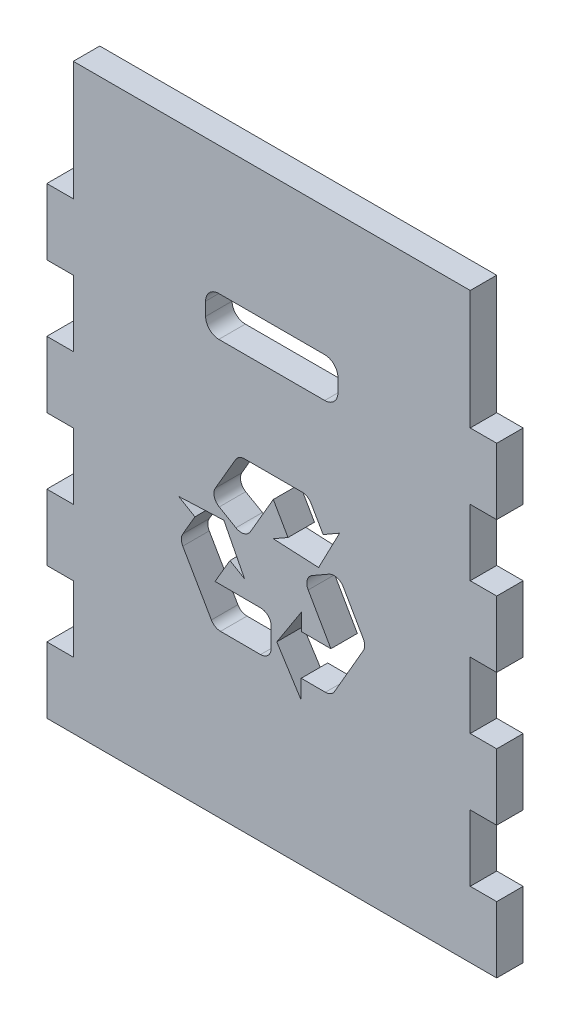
ISO-10303-21;
HEADER;
FILE_DESCRIPTION(('STEP AP214'),'2;1');
FILE_NAME('part.step','',(''),(''),'','','');
FILE_SCHEMA(('AUTOMOTIVE_DESIGN { 1 0 10303 214 1 1 1 1 }'));
ENDSEC;
DATA;
#1=APPLICATION_CONTEXT('core data for automotive mechanical design processes');
#2=APPLICATION_PROTOCOL_DEFINITION('international standard','automotive_design',2000,#1);
#3=PRODUCT_CONTEXT('',#1,'mechanical');
#4=PRODUCT('Part','Part','',(#3));
#5=PRODUCT_RELATED_PRODUCT_CATEGORY('part','',(#4));
#6=PRODUCT_DEFINITION_FORMATION('','',#4);
#7=PRODUCT_DEFINITION_CONTEXT('part definition',#1,'design');
#8=PRODUCT_DEFINITION('design','',#6,#7);
#9=PRODUCT_DEFINITION_SHAPE('','',#8);
#10=(LENGTH_UNIT() NAMED_UNIT(*) SI_UNIT(.MILLI.,.METRE.));
#11=(NAMED_UNIT(*) PLANE_ANGLE_UNIT() SI_UNIT($,.RADIAN.));
#12=(NAMED_UNIT(*) SI_UNIT($,.STERADIAN.) SOLID_ANGLE_UNIT());
#13=UNCERTAINTY_MEASURE_WITH_UNIT(LENGTH_MEASURE(1.E-05),#10,'distance_accuracy_value','');
#14=(GEOMETRIC_REPRESENTATION_CONTEXT(3) GLOBAL_UNCERTAINTY_ASSIGNED_CONTEXT((#13)) GLOBAL_UNIT_ASSIGNED_CONTEXT((#10,
#11,#12)) REPRESENTATION_CONTEXT('',''));
#15=CARTESIAN_POINT('',(0.,0.,0.));
#16=DIRECTION('',(0.,0.,1.));
#17=DIRECTION('',(1.,0.,0.));
#18=AXIS2_PLACEMENT_3D('',#15,#16,#17);
#19=CARTESIAN_POINT('',(340.,50.,20.));
#20=DIRECTION('',(-1.,0.,0.));
#21=DIRECTION('',(0.,0.,1.));
#22=AXIS2_PLACEMENT_3D('',#19,#20,#21);
#23=PLANE('',#22);
#24=DIRECTION('',(0.,1.,0.));
#25=VECTOR('',#24,1.);
#26=CARTESIAN_POINT('',(340.,50.,0.));
#27=LINE('',#26,#25);
#28=CARTESIAN_POINT('',(340.,50.,0.));
#29=VERTEX_POINT('',#28);
#30=CARTESIAN_POINT('',(340.,100.,0.));
#31=VERTEX_POINT('',#30);
#32=EDGE_CURVE('E929',#29,#31,#27,.T.);
#33=ORIENTED_EDGE('',*,*,#32,.T.);
#34=DIRECTION('',(0.,0.,-1.));
#35=VECTOR('',#34,1.);
#36=CARTESIAN_POINT('',(340.,100.,20.));
#37=LINE('',#36,#35);
#38=CARTESIAN_POINT('',(340.,100.,20.));
#39=VERTEX_POINT('',#38);
#40=EDGE_CURVE('E38',#39,#31,#37,.T.);
#41=ORIENTED_EDGE('',*,*,#40,.F.);
#42=DIRECTION('',(0.,1.,0.));
#43=VECTOR('',#42,1.);
#44=CARTESIAN_POINT('',(340.,50.,20.));
#45=LINE('',#44,#43);
#46=CARTESIAN_POINT('',(340.,50.,20.));
#47=VERTEX_POINT('',#46);
#48=EDGE_CURVE('E946',#47,#39,#45,.T.);
#49=ORIENTED_EDGE('',*,*,#48,.F.);
#50=DIRECTION('',(0.,0.,-1.));
#51=VECTOR('',#50,1.);
#52=CARTESIAN_POINT('',(340.,50.,20.));
#53=LINE('',#52,#51);
#54=EDGE_CURVE('E11',#47,#29,#53,.T.);
#55=ORIENTED_EDGE('',*,*,#54,.T.);
#56=EDGE_LOOP('',(#33,#41,#49,#55));
#57=FACE_BOUND('',#56,.T.);
#58=ADVANCED_FACE('F31',(#57),#23,.F.);
#59=CARTESIAN_POINT('',(320.,100.,20.));
#60=DIRECTION('',(0.,-1.,0.));
#61=DIRECTION('',(0.,0.,-1.));
#62=AXIS2_PLACEMENT_3D('',#59,#60,#61);
#63=PLANE('',#62);
#64=DIRECTION('',(-1.,0.,0.));
#65=VECTOR('',#64,1.);
#66=CARTESIAN_POINT('',(320.,100.,0.));
#67=LINE('',#66,#65);
#68=CARTESIAN_POINT('',(320.,100.,0.));
#69=VERTEX_POINT('',#68);
#70=EDGE_CURVE('E1012',#31,#69,#67,.T.);
#71=ORIENTED_EDGE('',*,*,#70,.T.);
#72=DIRECTION('',(0.,0.,-1.));
#73=VECTOR('',#72,1.);
#74=CARTESIAN_POINT('',(320.,100.,20.));
#75=LINE('',#74,#73);
#76=CARTESIAN_POINT('',(320.,100.,20.));
#77=VERTEX_POINT('',#76);
#78=EDGE_CURVE('E1159',#77,#69,#75,.T.);
#79=ORIENTED_EDGE('',*,*,#78,.F.);
#80=DIRECTION('',(-1.,0.,0.));
#81=VECTOR('',#80,1.);
#82=CARTESIAN_POINT('',(320.,100.,20.));
#83=LINE('',#82,#81);
#84=EDGE_CURVE('E949',#39,#77,#83,.T.);
#85=ORIENTED_EDGE('',*,*,#84,.F.);
#86=ORIENTED_EDGE('',*,*,#40,.T.);
#87=EDGE_LOOP('',(#71,#79,#85,#86));
#88=FACE_BOUND('',#87,.T.);
#89=ADVANCED_FACE('F1166',(#88),#63,.F.);
#90=CARTESIAN_POINT('',(320.,150.,20.));
#91=DIRECTION('',(-1.,0.,0.));
#92=DIRECTION('',(0.,-1.,0.));
#93=AXIS2_PLACEMENT_3D('',#90,#91,#92);
#94=PLANE('',#93);
#95=DIRECTION('',(0.,1.,0.));
#96=VECTOR('',#95,1.);
#97=CARTESIAN_POINT('',(320.,150.,0.));
#98=LINE('',#97,#96);
#99=CARTESIAN_POINT('',(320.,150.,0.));
#100=VERTEX_POINT('',#99);
#101=EDGE_CURVE('E1014',#69,#100,#98,.T.);
#102=ORIENTED_EDGE('',*,*,#101,.T.);
#103=DIRECTION('',(0.,0.,-1.));
#104=VECTOR('',#103,1.);
#105=CARTESIAN_POINT('',(320.,150.,20.));
#106=LINE('',#105,#104);
#107=CARTESIAN_POINT('',(320.,150.,20.));
#108=VERTEX_POINT('',#107);
#109=EDGE_CURVE('E1156',#108,#100,#106,.T.);
#110=ORIENTED_EDGE('',*,*,#109,.F.);
#111=DIRECTION('',(0.,1.,0.));
#112=VECTOR('',#111,1.);
#113=CARTESIAN_POINT('',(320.,150.,20.));
#114=LINE('',#113,#112);
#115=EDGE_CURVE('E951',#77,#108,#114,.T.);
#116=ORIENTED_EDGE('',*,*,#115,.F.);
#117=ORIENTED_EDGE('',*,*,#78,.T.);
#118=EDGE_LOOP('',(#102,#110,#116,#117));
#119=FACE_BOUND('',#118,.T.);
#120=ADVANCED_FACE('F1178',(#119),#94,.F.);
#121=CARTESIAN_POINT('',(320.,150.,20.));
#122=DIRECTION('',(0.,1.,0.));
#123=DIRECTION('',(0.,0.,1.));
#124=AXIS2_PLACEMENT_3D('',#121,#122,#123);
#125=PLANE('',#124);
#126=DIRECTION('',(1.,0.,0.));
#127=VECTOR('',#126,1.);
#128=CARTESIAN_POINT('',(320.,150.,0.));
#129=LINE('',#128,#127);
#130=CARTESIAN_POINT('',(340.,150.,0.));
#131=VERTEX_POINT('',#130);
#132=EDGE_CURVE('E1016',#100,#131,#129,.T.);
#133=ORIENTED_EDGE('',*,*,#132,.T.);
#134=DIRECTION('',(0.,0.,-1.));
#135=VECTOR('',#134,1.);
#136=CARTESIAN_POINT('',(340.,150.,20.));
#137=LINE('',#136,#135);
#138=CARTESIAN_POINT('',(340.,150.,20.));
#139=VERTEX_POINT('',#138);
#140=EDGE_CURVE('E1153',#139,#131,#137,.T.);
#141=ORIENTED_EDGE('',*,*,#140,.F.);
#142=DIRECTION('',(1.,0.,0.));
#143=VECTOR('',#142,1.);
#144=CARTESIAN_POINT('',(320.,150.,20.));
#145=LINE('',#144,#143);
#146=EDGE_CURVE('E953',#108,#139,#145,.T.);
#147=ORIENTED_EDGE('',*,*,#146,.F.);
#148=ORIENTED_EDGE('',*,*,#109,.T.);
#149=EDGE_LOOP('',(#133,#141,#147,#148));
#150=FACE_BOUND('',#149,.T.);
#151=ADVANCED_FACE('F1182',(#150),#125,.F.);
#152=CARTESIAN_POINT('',(340.,150.,20.));
#153=DIRECTION('',(-1.,0.,0.));
#154=DIRECTION('',(0.,0.,1.));
#155=AXIS2_PLACEMENT_3D('',#152,#153,#154);
#156=PLANE('',#155);
#157=DIRECTION('',(0.,1.,0.));
#158=VECTOR('',#157,1.);
#159=CARTESIAN_POINT('',(340.,150.,0.));
#160=LINE('',#159,#158);
#161=CARTESIAN_POINT('',(340.,200.,0.));
#162=VERTEX_POINT('',#161);
#163=EDGE_CURVE('E1018',#131,#162,#160,.T.);
#164=ORIENTED_EDGE('',*,*,#163,.T.);
#165=DIRECTION('',(0.,0.,-1.));
#166=VECTOR('',#165,1.);
#167=CARTESIAN_POINT('',(340.,200.,20.));
#168=LINE('',#167,#166);
#169=CARTESIAN_POINT('',(340.,200.,20.));
#170=VERTEX_POINT('',#169);
#171=EDGE_CURVE('E1150',#170,#162,#168,.T.);
#172=ORIENTED_EDGE('',*,*,#171,.F.);
#173=DIRECTION('',(0.,1.,0.));
#174=VECTOR('',#173,1.);
#175=CARTESIAN_POINT('',(340.,150.,20.));
#176=LINE('',#175,#174);
#177=EDGE_CURVE('E955',#139,#170,#176,.T.);
#178=ORIENTED_EDGE('',*,*,#177,.F.);
#179=ORIENTED_EDGE('',*,*,#140,.T.);
#180=EDGE_LOOP('',(#164,#172,#178,#179));
#181=FACE_BOUND('',#180,.T.);
#182=ADVANCED_FACE('F1322',(#181),#156,.F.);
#183=CARTESIAN_POINT('',(320.,200.,20.));
#184=DIRECTION('',(0.,-1.,0.));
#185=DIRECTION('',(0.,0.,-1.));
#186=AXIS2_PLACEMENT_3D('',#183,#184,#185);
#187=PLANE('',#186);
#188=DIRECTION('',(-1.,0.,0.));
#189=VECTOR('',#188,1.);
#190=CARTESIAN_POINT('',(320.,200.,0.));
#191=LINE('',#190,#189);
#192=CARTESIAN_POINT('',(320.,200.,0.));
#193=VERTEX_POINT('',#192);
#194=EDGE_CURVE('E1020',#162,#193,#191,.T.);
#195=ORIENTED_EDGE('',*,*,#194,.T.);
#196=DIRECTION('',(0.,0.,-1.));
#197=VECTOR('',#196,1.);
#198=CARTESIAN_POINT('',(320.,200.,20.));
#199=LINE('',#198,#197);
#200=CARTESIAN_POINT('',(320.,200.,20.));
#201=VERTEX_POINT('',#200);
#202=EDGE_CURVE('E1147',#201,#193,#199,.T.);
#203=ORIENTED_EDGE('',*,*,#202,.F.);
#204=DIRECTION('',(-1.,0.,0.));
#205=VECTOR('',#204,1.);
#206=CARTESIAN_POINT('',(320.,200.,20.));
#207=LINE('',#206,#205);
#208=EDGE_CURVE('E957',#170,#201,#207,.T.);
#209=ORIENTED_EDGE('',*,*,#208,.F.);
#210=ORIENTED_EDGE('',*,*,#171,.T.);
#211=EDGE_LOOP('',(#195,#203,#209,#210));
#212=FACE_BOUND('',#211,.T.);
#213=ADVANCED_FACE('F1320',(#212),#187,.F.);
#214=CARTESIAN_POINT('',(320.,250.,20.));
#215=DIRECTION('',(-1.,0.,0.));
#216=DIRECTION('',(0.,0.,1.));
#217=AXIS2_PLACEMENT_3D('',#214,#215,#216);
#218=PLANE('',#217);
#219=DIRECTION('',(0.,1.,0.));
#220=VECTOR('',#219,1.);
#221=CARTESIAN_POINT('',(320.,250.,0.));
#222=LINE('',#221,#220);
#223=CARTESIAN_POINT('',(320.,250.,0.));
#224=VERTEX_POINT('',#223);
#225=EDGE_CURVE('E1022',#193,#224,#222,.T.);
#226=ORIENTED_EDGE('',*,*,#225,.T.);
#227=DIRECTION('',(0.,0.,-1.));
#228=VECTOR('',#227,1.);
#229=CARTESIAN_POINT('',(320.,250.,20.));
#230=LINE('',#229,#228);
#231=CARTESIAN_POINT('',(320.,250.,20.));
#232=VERTEX_POINT('',#231);
#233=EDGE_CURVE('E1144',#232,#224,#230,.T.);
#234=ORIENTED_EDGE('',*,*,#233,.F.);
#235=DIRECTION('',(0.,1.,0.));
#236=VECTOR('',#235,1.);
#237=CARTESIAN_POINT('',(320.,250.,20.));
#238=LINE('',#237,#236);
#239=EDGE_CURVE('E959',#201,#232,#238,.T.);
#240=ORIENTED_EDGE('',*,*,#239,.F.);
#241=ORIENTED_EDGE('',*,*,#202,.T.);
#242=EDGE_LOOP('',(#226,#234,#240,#241));
#243=FACE_BOUND('',#242,.T.);
#244=ADVANCED_FACE('F1315',(#243),#218,.F.);
#245=CARTESIAN_POINT('',(320.,250.,20.));
#246=DIRECTION('',(0.,1.,0.));
#247=DIRECTION('',(0.,0.,1.));
#248=AXIS2_PLACEMENT_3D('',#245,#246,#247);
#249=PLANE('',#248);
#250=DIRECTION('',(1.,0.,0.));
#251=VECTOR('',#250,1.);
#252=CARTESIAN_POINT('',(320.,250.,0.));
#253=LINE('',#252,#251);
#254=CARTESIAN_POINT('',(340.,250.,0.));
#255=VERTEX_POINT('',#254);
#256=EDGE_CURVE('E1024',#224,#255,#253,.T.);
#257=ORIENTED_EDGE('',*,*,#256,.T.);
#258=DIRECTION('',(0.,0.,-1.));
#259=VECTOR('',#258,1.);
#260=CARTESIAN_POINT('',(340.,250.,20.));
#261=LINE('',#260,#259);
#262=CARTESIAN_POINT('',(340.,250.,20.));
#263=VERTEX_POINT('',#262);
#264=EDGE_CURVE('E1141',#263,#255,#261,.T.);
#265=ORIENTED_EDGE('',*,*,#264,.F.);
#266=DIRECTION('',(1.,0.,0.));
#267=VECTOR('',#266,1.);
#268=CARTESIAN_POINT('',(320.,250.,20.));
#269=LINE('',#268,#267);
#270=EDGE_CURVE('E961',#232,#263,#269,.T.);
#271=ORIENTED_EDGE('',*,*,#270,.F.);
#272=ORIENTED_EDGE('',*,*,#233,.T.);
#273=EDGE_LOOP('',(#257,#265,#271,#272));
#274=FACE_BOUND('',#273,.T.);
#275=ADVANCED_FACE('F1310',(#274),#249,.F.);
#276=CARTESIAN_POINT('',(340.,250.,20.));
#277=DIRECTION('',(-1.,0.,0.));
#278=DIRECTION('',(0.,0.,1.));
#279=AXIS2_PLACEMENT_3D('',#276,#277,#278);
#280=PLANE('',#279);
#281=DIRECTION('',(0.,1.,0.));
#282=VECTOR('',#281,1.);
#283=CARTESIAN_POINT('',(340.,250.,0.));
#284=LINE('',#283,#282);
#285=CARTESIAN_POINT('',(340.,300.,0.));
#286=VERTEX_POINT('',#285);
#287=EDGE_CURVE('E1026',#255,#286,#284,.T.);
#288=ORIENTED_EDGE('',*,*,#287,.T.);
#289=DIRECTION('',(0.,0.,-1.));
#290=VECTOR('',#289,1.);
#291=CARTESIAN_POINT('',(340.,300.,20.));
#292=LINE('',#291,#290);
#293=CARTESIAN_POINT('',(340.,300.,20.));
#294=VERTEX_POINT('',#293);
#295=EDGE_CURVE('E1138',#294,#286,#292,.T.);
#296=ORIENTED_EDGE('',*,*,#295,.F.);
#297=DIRECTION('',(0.,1.,0.));
#298=VECTOR('',#297,1.);
#299=CARTESIAN_POINT('',(340.,250.,20.));
#300=LINE('',#299,#298);
#301=EDGE_CURVE('E963',#263,#294,#300,.T.);
#302=ORIENTED_EDGE('',*,*,#301,.F.);
#303=ORIENTED_EDGE('',*,*,#264,.T.);
#304=EDGE_LOOP('',(#288,#296,#302,#303));
#305=FACE_BOUND('',#304,.T.);
#306=ADVANCED_FACE('F1306',(#305),#280,.F.);
#307=CARTESIAN_POINT('',(320.,300.,20.));
#308=DIRECTION('',(0.,-1.,0.));
#309=DIRECTION('',(0.,0.,-1.));
#310=AXIS2_PLACEMENT_3D('',#307,#308,#309);
#311=PLANE('',#310);
#312=DIRECTION('',(-1.,0.,0.));
#313=VECTOR('',#312,1.);
#314=CARTESIAN_POINT('',(320.,300.,0.));
#315=LINE('',#314,#313);
#316=CARTESIAN_POINT('',(320.,300.,0.));
#317=VERTEX_POINT('',#316);
#318=EDGE_CURVE('E1028',#286,#317,#315,.T.);
#319=ORIENTED_EDGE('',*,*,#318,.T.);
#320=DIRECTION('',(0.,0.,-1.));
#321=VECTOR('',#320,1.);
#322=CARTESIAN_POINT('',(320.,300.,20.));
#323=LINE('',#322,#321);
#324=CARTESIAN_POINT('',(320.,300.,20.));
#325=VERTEX_POINT('',#324);
#326=EDGE_CURVE('E1135',#325,#317,#323,.T.);
#327=ORIENTED_EDGE('',*,*,#326,.F.);
#328=DIRECTION('',(-1.,0.,0.));
#329=VECTOR('',#328,1.);
#330=CARTESIAN_POINT('',(320.,300.,20.));
#331=LINE('',#330,#329);
#332=EDGE_CURVE('E965',#294,#325,#331,.T.);
#333=ORIENTED_EDGE('',*,*,#332,.F.);
#334=ORIENTED_EDGE('',*,*,#295,.T.);
#335=EDGE_LOOP('',(#319,#327,#333,#334));
#336=FACE_BOUND('',#335,.T.);
#337=ADVANCED_FACE('F1301',(#336),#311,.F.);
#338=CARTESIAN_POINT('',(320.,350.,20.));
#339=DIRECTION('',(-1.,0.,0.));
#340=DIRECTION('',(0.,0.,1.));
#341=AXIS2_PLACEMENT_3D('',#338,#339,#340);
#342=PLANE('',#341);
#343=DIRECTION('',(0.,1.,0.));
#344=VECTOR('',#343,1.);
#345=CARTESIAN_POINT('',(320.,350.,0.));
#346=LINE('',#345,#344);
#347=CARTESIAN_POINT('',(320.,350.,0.));
#348=VERTEX_POINT('',#347);
#349=EDGE_CURVE('E1030',#317,#348,#346,.T.);
#350=ORIENTED_EDGE('',*,*,#349,.T.);
#351=DIRECTION('',(0.,0.,-1.));
#352=VECTOR('',#351,1.);
#353=CARTESIAN_POINT('',(320.,350.,20.));
#354=LINE('',#353,#352);
#355=CARTESIAN_POINT('',(320.,350.,20.));
#356=VERTEX_POINT('',#355);
#357=EDGE_CURVE('E1132',#356,#348,#354,.T.);
#358=ORIENTED_EDGE('',*,*,#357,.F.);
#359=DIRECTION('',(0.,1.,0.));
#360=VECTOR('',#359,1.);
#361=CARTESIAN_POINT('',(320.,350.,20.));
#362=LINE('',#361,#360);
#363=EDGE_CURVE('E967',#325,#356,#362,.T.);
#364=ORIENTED_EDGE('',*,*,#363,.F.);
#365=ORIENTED_EDGE('',*,*,#326,.T.);
#366=EDGE_LOOP('',(#350,#358,#364,#365));
#367=FACE_BOUND('',#366,.T.);
#368=ADVANCED_FACE('F1295',(#367),#342,.F.);
#369=CARTESIAN_POINT('',(320.,350.,20.));
#370=DIRECTION('',(0.,1.,0.));
#371=DIRECTION('',(0.,0.,1.));
#372=AXIS2_PLACEMENT_3D('',#369,#370,#371);
#373=PLANE('',#372);
#374=DIRECTION('',(1.,0.,0.));
#375=VECTOR('',#374,1.);
#376=CARTESIAN_POINT('',(320.,350.,0.));
#377=LINE('',#376,#375);
#378=CARTESIAN_POINT('',(340.,350.,0.));
#379=VERTEX_POINT('',#378);
#380=EDGE_CURVE('E1032',#348,#379,#377,.T.);
#381=ORIENTED_EDGE('',*,*,#380,.T.);
#382=DIRECTION('',(0.,0.,-1.));
#383=VECTOR('',#382,1.);
#384=CARTESIAN_POINT('',(340.,350.,20.));
#385=LINE('',#384,#383);
#386=CARTESIAN_POINT('',(340.,350.,20.));
#387=VERTEX_POINT('',#386);
#388=EDGE_CURVE('E1129',#387,#379,#385,.T.);
#389=ORIENTED_EDGE('',*,*,#388,.F.);
#390=DIRECTION('',(1.,0.,0.));
#391=VECTOR('',#390,1.);
#392=CARTESIAN_POINT('',(320.,350.,20.));
#393=LINE('',#392,#391);
#394=EDGE_CURVE('E969',#356,#387,#393,.T.);
#395=ORIENTED_EDGE('',*,*,#394,.F.);
#396=ORIENTED_EDGE('',*,*,#357,.T.);
#397=EDGE_LOOP('',(#381,#389,#395,#396));
#398=FACE_BOUND('',#397,.T.);
#399=ADVANCED_FACE('F1291',(#398),#373,.F.);
#400=CARTESIAN_POINT('',(340.,350.,20.));
#401=DIRECTION('',(-1.,0.,0.));
#402=DIRECTION('',(0.,0.,1.));
#403=AXIS2_PLACEMENT_3D('',#400,#401,#402);
#404=PLANE('',#403);
#405=DIRECTION('',(0.,1.,0.));
#406=VECTOR('',#405,1.);
#407=CARTESIAN_POINT('',(340.,350.,0.));
#408=LINE('',#407,#406);
#409=CARTESIAN_POINT('',(340.,400.,0.));
#410=VERTEX_POINT('',#409);
#411=EDGE_CURVE('E1034',#379,#410,#408,.T.);
#412=ORIENTED_EDGE('',*,*,#411,.T.);
#413=DIRECTION('',(0.,0.,-1.));
#414=VECTOR('',#413,1.);
#415=CARTESIAN_POINT('',(340.,400.,20.));
#416=LINE('',#415,#414);
#417=CARTESIAN_POINT('',(340.,400.,20.));
#418=VERTEX_POINT('',#417);
#419=EDGE_CURVE('E1126',#418,#410,#416,.T.);
#420=ORIENTED_EDGE('',*,*,#419,.F.);
#421=DIRECTION('',(0.,1.,0.));
#422=VECTOR('',#421,1.);
#423=CARTESIAN_POINT('',(340.,350.,20.));
#424=LINE('',#423,#422);
#425=EDGE_CURVE('E971',#387,#418,#424,.T.);
#426=ORIENTED_EDGE('',*,*,#425,.F.);
#427=ORIENTED_EDGE('',*,*,#388,.T.);
#428=EDGE_LOOP('',(#412,#420,#426,#427));
#429=FACE_BOUND('',#428,.T.);
#430=ADVANCED_FACE('F1286',(#429),#404,.F.);
#431=CARTESIAN_POINT('',(320.,400.,20.));
#432=DIRECTION('',(0.,-1.,0.));
#433=DIRECTION('',(0.,0.,-1.));
#434=AXIS2_PLACEMENT_3D('',#431,#432,#433);
#435=PLANE('',#434);
#436=DIRECTION('',(-1.,0.,0.));
#437=VECTOR('',#436,1.);
#438=CARTESIAN_POINT('',(320.,400.,0.));
#439=LINE('',#438,#437);
#440=CARTESIAN_POINT('',(320.,400.,0.));
#441=VERTEX_POINT('',#440);
#442=EDGE_CURVE('E1036',#410,#441,#439,.T.);
#443=ORIENTED_EDGE('',*,*,#442,.T.);
#444=DIRECTION('',(0.,0.,-1.));
#445=VECTOR('',#444,1.);
#446=CARTESIAN_POINT('',(320.,400.,20.));
#447=LINE('',#446,#445);
#448=CARTESIAN_POINT('',(320.,400.,20.));
#449=VERTEX_POINT('',#448);
#450=EDGE_CURVE('E1123',#449,#441,#447,.T.);
#451=ORIENTED_EDGE('',*,*,#450,.F.);
#452=DIRECTION('',(-1.,0.,0.));
#453=VECTOR('',#452,1.);
#454=CARTESIAN_POINT('',(320.,400.,20.));
#455=LINE('',#454,#453);
#456=EDGE_CURVE('E973',#418,#449,#455,.T.);
#457=ORIENTED_EDGE('',*,*,#456,.F.);
#458=ORIENTED_EDGE('',*,*,#419,.T.);
#459=EDGE_LOOP('',(#443,#451,#457,#458));
#460=FACE_BOUND('',#459,.T.);
#461=ADVANCED_FACE('F1280',(#460),#435,.F.);
#462=CARTESIAN_POINT('',(320.,490.,20.));
#463=DIRECTION('',(-1.,0.,0.));
#464=DIRECTION('',(0.,-1.,0.));
#465=AXIS2_PLACEMENT_3D('',#462,#463,#464);
#466=PLANE('',#465);
#467=DIRECTION('',(0.,1.,0.));
#468=VECTOR('',#467,1.);
#469=CARTESIAN_POINT('',(320.,490.,0.));
#470=LINE('',#469,#468);
#471=CARTESIAN_POINT('',(320.,490.,0.));
#472=VERTEX_POINT('',#471);
#473=EDGE_CURVE('E1038',#441,#472,#470,.T.);
#474=ORIENTED_EDGE('',*,*,#473,.T.);
#475=DIRECTION('',(0.,0.,-1.));
#476=VECTOR('',#475,1.);
#477=CARTESIAN_POINT('',(320.,490.,20.));
#478=LINE('',#477,#476);
#479=CARTESIAN_POINT('',(320.,490.,20.));
#480=VERTEX_POINT('',#479);
#481=EDGE_CURVE('E1120',#480,#472,#478,.T.);
#482=ORIENTED_EDGE('',*,*,#481,.F.);
#483=DIRECTION('',(0.,1.,0.));
#484=VECTOR('',#483,1.);
#485=CARTESIAN_POINT('',(320.,490.,20.));
#486=LINE('',#485,#484);
#487=EDGE_CURVE('E975',#449,#480,#486,.T.);
#488=ORIENTED_EDGE('',*,*,#487,.F.);
#489=ORIENTED_EDGE('',*,*,#450,.T.);
#490=EDGE_LOOP('',(#474,#482,#488,#489));
#491=FACE_BOUND('',#490,.T.);
#492=ADVANCED_FACE('F1276',(#491),#466,.F.);
#493=CARTESIAN_POINT('',(19.9999999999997,490.,20.));
#494=DIRECTION('',(0.,-1.,0.));
#495=DIRECTION('',(0.,0.,-1.));
#496=AXIS2_PLACEMENT_3D('',#493,#494,#495);
#497=PLANE('',#496);
#498=DIRECTION('',(-1.,0.,0.));
#499=VECTOR('',#498,1.);
#500=CARTESIAN_POINT('',(19.9999999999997,490.,0.));
#501=LINE('',#500,#499);
#502=CARTESIAN_POINT('',(19.9999999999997,490.,0.));
#503=VERTEX_POINT('',#502);
#504=EDGE_CURVE('E1040',#472,#503,#501,.T.);
#505=ORIENTED_EDGE('',*,*,#504,.T.);
#506=DIRECTION('',(0.,0.,-1.));
#507=VECTOR('',#506,1.);
#508=CARTESIAN_POINT('',(19.9999999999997,490.,20.));
#509=LINE('',#508,#507);
#510=CARTESIAN_POINT('',(19.9999999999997,490.,20.));
#511=VERTEX_POINT('',#510);
#512=EDGE_CURVE('E1117',#511,#503,#509,.T.);
#513=ORIENTED_EDGE('',*,*,#512,.F.);
#514=DIRECTION('',(-1.,0.,0.));
#515=VECTOR('',#514,1.);
#516=CARTESIAN_POINT('',(19.9999999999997,490.,20.));
#517=LINE('',#516,#515);
#518=EDGE_CURVE('E977',#480,#511,#517,.T.);
#519=ORIENTED_EDGE('',*,*,#518,.F.);
#520=ORIENTED_EDGE('',*,*,#481,.T.);
#521=EDGE_LOOP('',(#505,#513,#519,#520));
#522=FACE_BOUND('',#521,.T.);
#523=ADVANCED_FACE('F1271',(#522),#497,.F.);
#524=CARTESIAN_POINT('',(19.9999999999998,400.,20.));
#525=DIRECTION('',(1.,0.,0.));
#526=DIRECTION('',(0.,1.,0.));
#527=AXIS2_PLACEMENT_3D('',#524,#525,#526);
#528=PLANE('',#527);
#529=DIRECTION('',(0.,-1.,0.));
#530=VECTOR('',#529,1.);
#531=CARTESIAN_POINT('',(19.9999999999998,400.,0.));
#532=LINE('',#531,#530);
#533=CARTESIAN_POINT('',(19.9999999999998,400.,0.));
#534=VERTEX_POINT('',#533);
#535=EDGE_CURVE('E1042',#503,#534,#532,.T.);
#536=ORIENTED_EDGE('',*,*,#535,.T.);
#537=DIRECTION('',(0.,0.,-1.));
#538=VECTOR('',#537,1.);
#539=CARTESIAN_POINT('',(19.9999999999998,400.,20.));
#540=LINE('',#539,#538);
#541=CARTESIAN_POINT('',(19.9999999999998,400.,20.));
#542=VERTEX_POINT('',#541);
#543=EDGE_CURVE('E1114',#542,#534,#540,.T.);
#544=ORIENTED_EDGE('',*,*,#543,.F.);
#545=DIRECTION('',(0.,-1.,0.));
#546=VECTOR('',#545,1.);
#547=CARTESIAN_POINT('',(19.9999999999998,400.,20.));
#548=LINE('',#547,#546);
#549=EDGE_CURVE('E979',#511,#542,#548,.T.);
#550=ORIENTED_EDGE('',*,*,#549,.F.);
#551=ORIENTED_EDGE('',*,*,#512,.T.);
#552=EDGE_LOOP('',(#536,#544,#550,#551));
#553=FACE_BOUND('',#552,.T.);
#554=ADVANCED_FACE('F1265',(#553),#528,.F.);
#555=CARTESIAN_POINT('',(-1.74574168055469E-13,400.,20.));
#556=DIRECTION('',(0.,-1.,0.));
#557=DIRECTION('',(0.,0.,-1.));
#558=AXIS2_PLACEMENT_3D('',#555,#556,#557);
#559=PLANE('',#558);
#560=DIRECTION('',(-1.,0.,0.));
#561=VECTOR('',#560,1.);
#562=CARTESIAN_POINT('',(-1.74574168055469E-13,400.,0.));
#563=LINE('',#562,#561);
#564=CARTESIAN_POINT('',(-1.74574168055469E-13,400.,0.));
#565=VERTEX_POINT('',#564);
#566=EDGE_CURVE('E1044',#534,#565,#563,.T.);
#567=ORIENTED_EDGE('',*,*,#566,.T.);
#568=DIRECTION('',(0.,0.,-1.));
#569=VECTOR('',#568,1.);
#570=CARTESIAN_POINT('',(-1.74574168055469E-13,400.,20.));
#571=LINE('',#570,#569);
#572=CARTESIAN_POINT('',(-1.74574168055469E-13,400.,20.));
#573=VERTEX_POINT('',#572);
#574=EDGE_CURVE('E1111',#573,#565,#571,.T.);
#575=ORIENTED_EDGE('',*,*,#574,.F.);
#576=DIRECTION('',(-1.,0.,0.));
#577=VECTOR('',#576,1.);
#578=CARTESIAN_POINT('',(-1.74574168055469E-13,400.,20.));
#579=LINE('',#578,#577);
#580=EDGE_CURVE('E981',#542,#573,#579,.T.);
#581=ORIENTED_EDGE('',*,*,#580,.F.);
#582=ORIENTED_EDGE('',*,*,#543,.T.);
#583=EDGE_LOOP('',(#567,#575,#581,#582));
#584=FACE_BOUND('',#583,.T.);
#585=ADVANCED_FACE('F1261',(#584),#559,.F.);
#586=CARTESIAN_POINT('',(-1.74574168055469E-13,350.,20.));
#587=DIRECTION('',(1.,0.,0.));
#588=DIRECTION('',(0.,0.,-1.));
#589=AXIS2_PLACEMENT_3D('',#586,#587,#588);
#590=PLANE('',#589);
#591=DIRECTION('',(0.,-1.,0.));
#592=VECTOR('',#591,1.);
#593=CARTESIAN_POINT('',(-1.74574168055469E-13,350.,0.));
#594=LINE('',#593,#592);
#595=CARTESIAN_POINT('',(-1.74574168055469E-13,350.,0.));
#596=VERTEX_POINT('',#595);
#597=EDGE_CURVE('E1046',#565,#596,#594,.T.);
#598=ORIENTED_EDGE('',*,*,#597,.T.);
#599=DIRECTION('',(0.,0.,-1.));
#600=VECTOR('',#599,1.);
#601=CARTESIAN_POINT('',(-1.74574168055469E-13,350.,20.));
#602=LINE('',#601,#600);
#603=CARTESIAN_POINT('',(-1.74574168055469E-13,350.,20.));
#604=VERTEX_POINT('',#603);
#605=EDGE_CURVE('E1108',#604,#596,#602,.T.);
#606=ORIENTED_EDGE('',*,*,#605,.F.);
#607=DIRECTION('',(0.,-1.,0.));
#608=VECTOR('',#607,1.);
#609=CARTESIAN_POINT('',(-1.74574168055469E-13,350.,20.));
#610=LINE('',#609,#608);
#611=EDGE_CURVE('E983',#573,#604,#610,.T.);
#612=ORIENTED_EDGE('',*,*,#611,.F.);
#613=ORIENTED_EDGE('',*,*,#574,.T.);
#614=EDGE_LOOP('',(#598,#606,#612,#613));
#615=FACE_BOUND('',#614,.T.);
#616=ADVANCED_FACE('F1256',(#615),#590,.F.);
#617=CARTESIAN_POINT('',(-1.74574168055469E-13,350.,20.));
#618=DIRECTION('',(0.,1.,0.));
#619=DIRECTION('',(0.,0.,1.));
#620=AXIS2_PLACEMENT_3D('',#617,#618,#619);
#621=PLANE('',#620);
#622=DIRECTION('',(1.,0.,0.));
#623=VECTOR('',#622,1.);
#624=CARTESIAN_POINT('',(-1.74574168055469E-13,350.,0.));
#625=LINE('',#624,#623);
#626=CARTESIAN_POINT('',(19.9999999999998,350.,0.));
#627=VERTEX_POINT('',#626);
#628=EDGE_CURVE('E1048',#596,#627,#625,.T.);
#629=ORIENTED_EDGE('',*,*,#628,.T.);
#630=DIRECTION('',(0.,0.,-1.));
#631=VECTOR('',#630,1.);
#632=CARTESIAN_POINT('',(19.9999999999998,350.,20.));
#633=LINE('',#632,#631);
#634=CARTESIAN_POINT('',(19.9999999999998,350.,20.));
#635=VERTEX_POINT('',#634);
#636=EDGE_CURVE('E1105',#635,#627,#633,.T.);
#637=ORIENTED_EDGE('',*,*,#636,.F.);
#638=DIRECTION('',(1.,0.,0.));
#639=VECTOR('',#638,1.);
#640=CARTESIAN_POINT('',(-1.74574168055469E-13,350.,20.));
#641=LINE('',#640,#639);
#642=EDGE_CURVE('E985',#604,#635,#641,.T.);
#643=ORIENTED_EDGE('',*,*,#642,.F.);
#644=ORIENTED_EDGE('',*,*,#605,.T.);
#645=EDGE_LOOP('',(#629,#637,#643,#644));
#646=FACE_BOUND('',#645,.T.);
#647=ADVANCED_FACE('F1250',(#646),#621,.F.);
#648=CARTESIAN_POINT('',(19.9999999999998,300.,20.));
#649=DIRECTION('',(1.,0.,0.));
#650=DIRECTION('',(0.,0.,-1.));
#651=AXIS2_PLACEMENT_3D('',#648,#649,#650);
#652=PLANE('',#651);
#653=DIRECTION('',(0.,-1.,0.));
#654=VECTOR('',#653,1.);
#655=CARTESIAN_POINT('',(19.9999999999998,300.,0.));
#656=LINE('',#655,#654);
#657=CARTESIAN_POINT('',(19.9999999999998,300.,0.));
#658=VERTEX_POINT('',#657);
#659=EDGE_CURVE('E1050',#627,#658,#656,.T.);
#660=ORIENTED_EDGE('',*,*,#659,.T.);
#661=DIRECTION('',(0.,0.,-1.));
#662=VECTOR('',#661,1.);
#663=CARTESIAN_POINT('',(19.9999999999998,300.,20.));
#664=LINE('',#663,#662);
#665=CARTESIAN_POINT('',(19.9999999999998,300.,20.));
#666=VERTEX_POINT('',#665);
#667=EDGE_CURVE('E1102',#666,#658,#664,.T.);
#668=ORIENTED_EDGE('',*,*,#667,.F.);
#669=DIRECTION('',(0.,-1.,0.));
#670=VECTOR('',#669,1.);
#671=CARTESIAN_POINT('',(19.9999999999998,300.,20.));
#672=LINE('',#671,#670);
#673=EDGE_CURVE('E987',#635,#666,#672,.T.);
#674=ORIENTED_EDGE('',*,*,#673,.F.);
#675=ORIENTED_EDGE('',*,*,#636,.T.);
#676=EDGE_LOOP('',(#660,#668,#674,#675));
#677=FACE_BOUND('',#676,.T.);
#678=ADVANCED_FACE('F1246',(#677),#652,.F.);
#679=CARTESIAN_POINT('',(-1.74574168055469E-13,300.,20.));
#680=DIRECTION('',(0.,-1.,0.));
#681=DIRECTION('',(0.,0.,-1.));
#682=AXIS2_PLACEMENT_3D('',#679,#680,#681);
#683=PLANE('',#682);
#684=DIRECTION('',(-1.,0.,0.));
#685=VECTOR('',#684,1.);
#686=CARTESIAN_POINT('',(-1.74574168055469E-13,300.,0.));
#687=LINE('',#686,#685);
#688=CARTESIAN_POINT('',(-1.74574168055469E-13,300.,0.));
#689=VERTEX_POINT('',#688);
#690=EDGE_CURVE('E1052',#658,#689,#687,.T.);
#691=ORIENTED_EDGE('',*,*,#690,.T.);
#692=DIRECTION('',(0.,0.,-1.));
#693=VECTOR('',#692,1.);
#694=CARTESIAN_POINT('',(-1.74574168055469E-13,300.,20.));
#695=LINE('',#694,#693);
#696=CARTESIAN_POINT('',(-1.74574168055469E-13,300.,20.));
#697=VERTEX_POINT('',#696);
#698=EDGE_CURVE('E1099',#697,#689,#695,.T.);
#699=ORIENTED_EDGE('',*,*,#698,.F.);
#700=DIRECTION('',(-1.,0.,0.));
#701=VECTOR('',#700,1.);
#702=CARTESIAN_POINT('',(-1.74574168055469E-13,300.,20.));
#703=LINE('',#702,#701);
#704=EDGE_CURVE('E989',#666,#697,#703,.T.);
#705=ORIENTED_EDGE('',*,*,#704,.F.);
#706=ORIENTED_EDGE('',*,*,#667,.T.);
#707=EDGE_LOOP('',(#691,#699,#705,#706));
#708=FACE_BOUND('',#707,.T.);
#709=ADVANCED_FACE('F1241',(#708),#683,.F.);
#710=CARTESIAN_POINT('',(-1.74574168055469E-13,250.,20.));
#711=DIRECTION('',(1.,0.,0.));
#712=DIRECTION('',(0.,0.,-1.));
#713=AXIS2_PLACEMENT_3D('',#710,#711,#712);
#714=PLANE('',#713);
#715=DIRECTION('',(0.,-1.,0.));
#716=VECTOR('',#715,1.);
#717=CARTESIAN_POINT('',(-1.74574168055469E-13,250.,0.));
#718=LINE('',#717,#716);
#719=CARTESIAN_POINT('',(-1.74574168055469E-13,250.,0.));
#720=VERTEX_POINT('',#719);
#721=EDGE_CURVE('E1054',#689,#720,#718,.T.);
#722=ORIENTED_EDGE('',*,*,#721,.T.);
#723=DIRECTION('',(0.,0.,-1.));
#724=VECTOR('',#723,1.);
#725=CARTESIAN_POINT('',(-1.74574168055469E-13,250.,20.));
#726=LINE('',#725,#724);
#727=CARTESIAN_POINT('',(-1.74574168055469E-13,250.,20.));
#728=VERTEX_POINT('',#727);
#729=EDGE_CURVE('E1096',#728,#720,#726,.T.);
#730=ORIENTED_EDGE('',*,*,#729,.F.);
#731=DIRECTION('',(0.,-1.,0.));
#732=VECTOR('',#731,1.);
#733=CARTESIAN_POINT('',(-1.74574168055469E-13,250.,20.));
#734=LINE('',#733,#732);
#735=EDGE_CURVE('E991',#697,#728,#734,.T.);
#736=ORIENTED_EDGE('',*,*,#735,.F.);
#737=ORIENTED_EDGE('',*,*,#698,.T.);
#738=EDGE_LOOP('',(#722,#730,#736,#737));
#739=FACE_BOUND('',#738,.T.);
#740=ADVANCED_FACE('F1235',(#739),#714,.F.);
#741=CARTESIAN_POINT('',(-1.74574168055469E-13,250.,20.));
#742=DIRECTION('',(0.,1.,0.));
#743=DIRECTION('',(0.,0.,1.));
#744=AXIS2_PLACEMENT_3D('',#741,#742,#743);
#745=PLANE('',#744);
#746=DIRECTION('',(1.,0.,0.));
#747=VECTOR('',#746,1.);
#748=CARTESIAN_POINT('',(-1.74574168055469E-13,250.,0.));
#749=LINE('',#748,#747);
#750=CARTESIAN_POINT('',(19.9999999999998,250.,0.));
#751=VERTEX_POINT('',#750);
#752=EDGE_CURVE('E1056',#720,#751,#749,.T.);
#753=ORIENTED_EDGE('',*,*,#752,.T.);
#754=DIRECTION('',(0.,0.,-1.));
#755=VECTOR('',#754,1.);
#756=CARTESIAN_POINT('',(19.9999999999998,250.,20.));
#757=LINE('',#756,#755);
#758=CARTESIAN_POINT('',(19.9999999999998,250.,20.));
#759=VERTEX_POINT('',#758);
#760=EDGE_CURVE('E1093',#759,#751,#757,.T.);
#761=ORIENTED_EDGE('',*,*,#760,.F.);
#762=DIRECTION('',(1.,0.,0.));
#763=VECTOR('',#762,1.);
#764=CARTESIAN_POINT('',(-1.74574168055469E-13,250.,20.));
#765=LINE('',#764,#763);
#766=EDGE_CURVE('E993',#728,#759,#765,.T.);
#767=ORIENTED_EDGE('',*,*,#766,.F.);
#768=ORIENTED_EDGE('',*,*,#729,.T.);
#769=EDGE_LOOP('',(#753,#761,#767,#768));
#770=FACE_BOUND('',#769,.T.);
#771=ADVANCED_FACE('F1231',(#770),#745,.F.);
#772=CARTESIAN_POINT('',(19.9999999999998,200.,20.));
#773=DIRECTION('',(1.,0.,0.));
#774=DIRECTION('',(0.,0.,-1.));
#775=AXIS2_PLACEMENT_3D('',#772,#773,#774);
#776=PLANE('',#775);
#777=DIRECTION('',(0.,-1.,0.));
#778=VECTOR('',#777,1.);
#779=CARTESIAN_POINT('',(19.9999999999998,200.,0.));
#780=LINE('',#779,#778);
#781=CARTESIAN_POINT('',(19.9999999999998,200.,0.));
#782=VERTEX_POINT('',#781);
#783=EDGE_CURVE('E1058',#751,#782,#780,.T.);
#784=ORIENTED_EDGE('',*,*,#783,.T.);
#785=DIRECTION('',(0.,0.,-1.));
#786=VECTOR('',#785,1.);
#787=CARTESIAN_POINT('',(19.9999999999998,200.,20.));
#788=LINE('',#787,#786);
#789=CARTESIAN_POINT('',(19.9999999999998,200.,20.));
#790=VERTEX_POINT('',#789);
#791=EDGE_CURVE('E1090',#790,#782,#788,.T.);
#792=ORIENTED_EDGE('',*,*,#791,.F.);
#793=DIRECTION('',(0.,-1.,0.));
#794=VECTOR('',#793,1.);
#795=CARTESIAN_POINT('',(19.9999999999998,200.,20.));
#796=LINE('',#795,#794);
#797=EDGE_CURVE('E995',#759,#790,#796,.T.);
#798=ORIENTED_EDGE('',*,*,#797,.F.);
#799=ORIENTED_EDGE('',*,*,#760,.T.);
#800=EDGE_LOOP('',(#784,#792,#798,#799));
#801=FACE_BOUND('',#800,.T.);
#802=ADVANCED_FACE('F1226',(#801),#776,.F.);
#803=CARTESIAN_POINT('',(-1.74574168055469E-13,200.,20.));
#804=DIRECTION('',(0.,-1.,0.));
#805=DIRECTION('',(0.,0.,-1.));
#806=AXIS2_PLACEMENT_3D('',#803,#804,#805);
#807=PLANE('',#806);
#808=DIRECTION('',(-1.,0.,0.));
#809=VECTOR('',#808,1.);
#810=CARTESIAN_POINT('',(-1.74574168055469E-13,200.,0.));
#811=LINE('',#810,#809);
#812=CARTESIAN_POINT('',(-1.74574168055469E-13,200.,0.));
#813=VERTEX_POINT('',#812);
#814=EDGE_CURVE('E1060',#782,#813,#811,.T.);
#815=ORIENTED_EDGE('',*,*,#814,.T.);
#816=DIRECTION('',(0.,0.,-1.));
#817=VECTOR('',#816,1.);
#818=CARTESIAN_POINT('',(-1.74574168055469E-13,200.,20.));
#819=LINE('',#818,#817);
#820=CARTESIAN_POINT('',(-1.74574168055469E-13,200.,20.));
#821=VERTEX_POINT('',#820);
#822=EDGE_CURVE('E1087',#821,#813,#819,.T.);
#823=ORIENTED_EDGE('',*,*,#822,.F.);
#824=DIRECTION('',(-1.,0.,0.));
#825=VECTOR('',#824,1.);
#826=CARTESIAN_POINT('',(-1.74574168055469E-13,200.,20.));
#827=LINE('',#826,#825);
#828=EDGE_CURVE('E997',#790,#821,#827,.T.);
#829=ORIENTED_EDGE('',*,*,#828,.F.);
#830=ORIENTED_EDGE('',*,*,#791,.T.);
#831=EDGE_LOOP('',(#815,#823,#829,#830));
#832=FACE_BOUND('',#831,.T.);
#833=ADVANCED_FACE('F1220',(#832),#807,.F.);
#834=CARTESIAN_POINT('',(-1.74574168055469E-13,150.,20.));
#835=DIRECTION('',(1.,0.,0.));
#836=DIRECTION('',(0.,0.,-1.));
#837=AXIS2_PLACEMENT_3D('',#834,#835,#836);
#838=PLANE('',#837);
#839=DIRECTION('',(0.,-1.,0.));
#840=VECTOR('',#839,1.);
#841=CARTESIAN_POINT('',(-1.74574168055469E-13,150.,0.));
#842=LINE('',#841,#840);
#843=CARTESIAN_POINT('',(-1.74574168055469E-13,150.,0.));
#844=VERTEX_POINT('',#843);
#845=EDGE_CURVE('E1062',#813,#844,#842,.T.);
#846=ORIENTED_EDGE('',*,*,#845,.T.);
#847=DIRECTION('',(0.,0.,-1.));
#848=VECTOR('',#847,1.);
#849=CARTESIAN_POINT('',(-1.74574168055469E-13,150.,20.));
#850=LINE('',#849,#848);
#851=CARTESIAN_POINT('',(-1.74574168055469E-13,150.,20.));
#852=VERTEX_POINT('',#851);
#853=EDGE_CURVE('E1084',#852,#844,#850,.T.);
#854=ORIENTED_EDGE('',*,*,#853,.F.);
#855=DIRECTION('',(0.,-1.,0.));
#856=VECTOR('',#855,1.);
#857=CARTESIAN_POINT('',(-1.74574168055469E-13,150.,20.));
#858=LINE('',#857,#856);
#859=EDGE_CURVE('E999',#821,#852,#858,.T.);
#860=ORIENTED_EDGE('',*,*,#859,.F.);
#861=ORIENTED_EDGE('',*,*,#822,.T.);
#862=EDGE_LOOP('',(#846,#854,#860,#861));
#863=FACE_BOUND('',#862,.T.);
#864=ADVANCED_FACE('F1216',(#863),#838,.F.);
#865=CARTESIAN_POINT('',(-1.74574168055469E-13,150.,20.));
#866=DIRECTION('',(0.,1.,0.));
#867=DIRECTION('',(0.,0.,1.));
#868=AXIS2_PLACEMENT_3D('',#865,#866,#867);
#869=PLANE('',#868);
#870=DIRECTION('',(1.,0.,0.));
#871=VECTOR('',#870,1.);
#872=CARTESIAN_POINT('',(-1.74574168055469E-13,150.,0.));
#873=LINE('',#872,#871);
#874=CARTESIAN_POINT('',(19.9999999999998,150.,0.));
#875=VERTEX_POINT('',#874);
#876=EDGE_CURVE('E1064',#844,#875,#873,.T.);
#877=ORIENTED_EDGE('',*,*,#876,.T.);
#878=DIRECTION('',(0.,0.,-1.));
#879=VECTOR('',#878,1.);
#880=CARTESIAN_POINT('',(19.9999999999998,150.,20.));
#881=LINE('',#880,#879);
#882=CARTESIAN_POINT('',(19.9999999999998,150.,20.));
#883=VERTEX_POINT('',#882);
#884=EDGE_CURVE('E1081',#883,#875,#881,.T.);
#885=ORIENTED_EDGE('',*,*,#884,.F.);
#886=DIRECTION('',(1.,0.,0.));
#887=VECTOR('',#886,1.);
#888=CARTESIAN_POINT('',(-1.74574168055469E-13,150.,20.));
#889=LINE('',#888,#887);
#890=EDGE_CURVE('E1001',#852,#883,#889,.T.);
#891=ORIENTED_EDGE('',*,*,#890,.F.);
#892=ORIENTED_EDGE('',*,*,#853,.T.);
#893=EDGE_LOOP('',(#877,#885,#891,#892));
#894=FACE_BOUND('',#893,.T.);
#895=ADVANCED_FACE('F1211',(#894),#869,.F.);
#896=CARTESIAN_POINT('',(19.9999999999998,100.,20.));
#897=DIRECTION('',(1.,0.,0.));
#898=DIRECTION('',(0.,0.,-1.));
#899=AXIS2_PLACEMENT_3D('',#896,#897,#898);
#900=PLANE('',#899);
#901=DIRECTION('',(0.,-1.,0.));
#902=VECTOR('',#901,1.);
#903=CARTESIAN_POINT('',(19.9999999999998,100.,0.));
#904=LINE('',#903,#902);
#905=CARTESIAN_POINT('',(19.9999999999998,100.,0.));
#906=VERTEX_POINT('',#905);
#907=EDGE_CURVE('E1066',#875,#906,#904,.T.);
#908=ORIENTED_EDGE('',*,*,#907,.T.);
#909=DIRECTION('',(0.,0.,-1.));
#910=VECTOR('',#909,1.);
#911=CARTESIAN_POINT('',(19.9999999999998,100.,20.));
#912=LINE('',#911,#910);
#913=CARTESIAN_POINT('',(19.9999999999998,100.,20.));
#914=VERTEX_POINT('',#913);
#915=EDGE_CURVE('E1078',#914,#906,#912,.T.);
#916=ORIENTED_EDGE('',*,*,#915,.F.);
#917=DIRECTION('',(0.,-1.,0.));
#918=VECTOR('',#917,1.);
#919=CARTESIAN_POINT('',(19.9999999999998,100.,20.));
#920=LINE('',#919,#918);
#921=EDGE_CURVE('E1003',#883,#914,#920,.T.);
#922=ORIENTED_EDGE('',*,*,#921,.F.);
#923=ORIENTED_EDGE('',*,*,#884,.T.);
#924=EDGE_LOOP('',(#908,#916,#922,#923));
#925=FACE_BOUND('',#924,.T.);
#926=ADVANCED_FACE('F1205',(#925),#900,.F.);
#927=CARTESIAN_POINT('',(-1.74574168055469E-13,100.,20.));
#928=DIRECTION('',(0.,-1.,0.));
#929=DIRECTION('',(0.,0.,-1.));
#930=AXIS2_PLACEMENT_3D('',#927,#928,#929);
#931=PLANE('',#930);
#932=DIRECTION('',(-1.,0.,0.));
#933=VECTOR('',#932,1.);
#934=CARTESIAN_POINT('',(-1.74574168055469E-13,100.,0.));
#935=LINE('',#934,#933);
#936=CARTESIAN_POINT('',(-1.74574168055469E-13,100.,0.));
#937=VERTEX_POINT('',#936);
#938=EDGE_CURVE('E1068',#906,#937,#935,.T.);
#939=ORIENTED_EDGE('',*,*,#938,.T.);
#940=DIRECTION('',(0.,0.,-1.));
#941=VECTOR('',#940,1.);
#942=CARTESIAN_POINT('',(-1.74574168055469E-13,100.,20.));
#943=LINE('',#942,#941);
#944=CARTESIAN_POINT('',(-1.74574168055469E-13,100.,20.));
#945=VERTEX_POINT('',#944);
#946=EDGE_CURVE('E1075',#945,#937,#943,.T.);
#947=ORIENTED_EDGE('',*,*,#946,.F.);
#948=DIRECTION('',(-1.,0.,0.));
#949=VECTOR('',#948,1.);
#950=CARTESIAN_POINT('',(-1.74574168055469E-13,100.,20.));
#951=LINE('',#950,#949);
#952=EDGE_CURVE('E1005',#914,#945,#951,.T.);
#953=ORIENTED_EDGE('',*,*,#952,.F.);
#954=ORIENTED_EDGE('',*,*,#915,.T.);
#955=EDGE_LOOP('',(#939,#947,#953,#954));
#956=FACE_BOUND('',#955,.T.);
#957=ADVANCED_FACE('F1201',(#956),#931,.F.);
#958=CARTESIAN_POINT('',(-1.74574168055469E-13,50.,20.));
#959=DIRECTION('',(1.,0.,0.));
#960=DIRECTION('',(0.,0.,-1.));
#961=AXIS2_PLACEMENT_3D('',#958,#959,#960);
#962=PLANE('',#961);
#963=DIRECTION('',(0.,-1.,0.));
#964=VECTOR('',#963,1.);
#965=CARTESIAN_POINT('',(-1.74574168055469E-13,50.,0.));
#966=LINE('',#965,#964);
#967=CARTESIAN_POINT('',(-1.74574168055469E-13,50.,0.));
#968=VERTEX_POINT('',#967);
#969=EDGE_CURVE('E1070',#937,#968,#966,.T.);
#970=ORIENTED_EDGE('',*,*,#969,.T.);
#971=DIRECTION('',(0.,0.,-1.));
#972=VECTOR('',#971,1.);
#973=CARTESIAN_POINT('',(-1.74574168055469E-13,50.,20.));
#974=LINE('',#973,#972);
#975=CARTESIAN_POINT('',(-1.74574168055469E-13,50.,20.));
#976=VERTEX_POINT('',#975);
#977=EDGE_CURVE('E1010',#976,#968,#974,.T.);
#978=ORIENTED_EDGE('',*,*,#977,.F.);
#979=DIRECTION('',(0.,-1.,0.));
#980=VECTOR('',#979,1.);
#981=CARTESIAN_POINT('',(-1.74574168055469E-13,50.,20.));
#982=LINE('',#981,#980);
#983=EDGE_CURVE('E1007',#945,#976,#982,.T.);
#984=ORIENTED_EDGE('',*,*,#983,.F.);
#985=ORIENTED_EDGE('',*,*,#946,.T.);
#986=EDGE_LOOP('',(#970,#978,#984,#985));
#987=FACE_BOUND('',#986,.T.);
#988=ADVANCED_FACE('F1196',(#987),#962,.F.);
#989=CARTESIAN_POINT('',(-1.74574168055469E-13,50.,20.));
#990=DIRECTION('',(0.,1.,0.));
#991=DIRECTION('',(0.,0.,1.));
#992=AXIS2_PLACEMENT_3D('',#989,#990,#991);
#993=PLANE('',#992);
#994=DIRECTION('',(1.,0.,0.));
#995=VECTOR('',#994,1.);
#996=CARTESIAN_POINT('',(-1.74574168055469E-13,50.,0.));
#997=LINE('',#996,#995);
#998=EDGE_CURVE('E947',#968,#29,#997,.T.);
#999=ORIENTED_EDGE('',*,*,#998,.T.);
#1000=ORIENTED_EDGE('',*,*,#54,.F.);
#1001=DIRECTION('',(1.,0.,0.));
#1002=VECTOR('',#1001,1.);
#1003=CARTESIAN_POINT('',(20.,50.,20.));
#1004=LINE('',#1003,#1002);
#1005=EDGE_CURVE('E944',#976,#47,#1004,.T.);
#1006=ORIENTED_EDGE('',*,*,#1005,.F.);
#1007=ORIENTED_EDGE('',*,*,#977,.T.);
#1008=EDGE_LOOP('',(#999,#1000,#1006,#1007));
#1009=FACE_BOUND('',#1008,.T.);
#1010=ADVANCED_FACE('F1190',(#1009),#993,.F.);
#1011=CARTESIAN_POINT('',(340.,50.,20.));
#1012=DIRECTION('',(0.,0.,1.));
#1013=DIRECTION('',(1.,0.,0.));
#1014=AXIS2_PLACEMENT_3D('',#1011,#1012,#1013);
#1015=PLANE('',#1014);
#1016=CARTESIAN_POINT('',(131.30439221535,180.532772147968,20.));
#1017=DIRECTION('',(0.,0.,1.));
#1018=DIRECTION('',(1.,0.,0.));
#1019=AXIS2_PLACEMENT_3D('',#1016,#1017,#1018);
#1020=CIRCLE('',#1019,8.0000000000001);
#1021=CARTESIAN_POINT('',(124.376188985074,176.532772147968,20.));
#1022=VERTEX_POINT('',#1021);
#1023=CARTESIAN_POINT('',(131.277582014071,172.532817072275,20.));
#1024=VERTEX_POINT('',#1023);
#1025=EDGE_CURVE('E45',#1022,#1024,#1020,.T.);
#1026=ORIENTED_EDGE('',*,*,#1025,.F.);
#1027=DIRECTION('',(0.499999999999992,-0.866025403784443,0.));
#1028=VECTOR('',#1027,1.);
#1029=CARTESIAN_POINT('',(124.376188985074,176.532772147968,20.));
#1030=LINE('',#1029,#1028);
#1031=CARTESIAN_POINT('',(102.737499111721,214.012082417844,20.));
#1032=VERTEX_POINT('',#1031);
#1033=EDGE_CURVE('E558',#1032,#1022,#1030,.T.);
#1034=ORIENTED_EDGE('',*,*,#1033,.F.);
#1035=CARTESIAN_POINT('',(109.665702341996,218.012082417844,20.));
#1036=DIRECTION('',(0.,0.,1.));
#1037=DIRECTION('',(-1.,0.,0.));
#1038=AXIS2_PLACEMENT_3D('',#1035,#1036,#1037);
#1039=CIRCLE('',#1038,7.99999999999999);
#1040=CARTESIAN_POINT('',(102.750943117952,222.035278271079,20.));
#1041=VERTEX_POINT('',#1040);
#1042=EDGE_CURVE('E561',#1041,#1032,#1039,.T.);
#1043=ORIENTED_EDGE('',*,*,#1042,.F.);
#1044=DIRECTION('',(-0.502899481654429,-0.864344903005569,0.));
#1045=VECTOR('',#1044,1.);
#1046=CARTESIAN_POINT('',(111.929834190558,237.81124942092,20.));
#1047=LINE('',#1046,#1045);
#1048=CARTESIAN_POINT('',(111.929834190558,237.81124942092,20.));
#1049=VERTEX_POINT('',#1048);
#1050=EDGE_CURVE('E625',#1049,#1041,#1047,.T.);
#1051=ORIENTED_EDGE('',*,*,#1050,.F.);
#1052=DIRECTION('',(0.864344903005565,-0.502899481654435,0.));
#1053=VECTOR('',#1052,1.);
#1054=CARTESIAN_POINT('',(111.929834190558,237.81124942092,20.));
#1055=LINE('',#1054,#1053);
#1056=CARTESIAN_POINT('',(99.533167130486,245.023969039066,20.));
#1057=VERTEX_POINT('',#1056);
#1058=EDGE_CURVE('E622',#1057,#1049,#1055,.T.);
#1059=ORIENTED_EDGE('',*,*,#1058,.F.);
#1060=DIRECTION('',(-0.999068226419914,-0.0431587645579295,0.));
#1061=VECTOR('',#1060,1.);
#1062=CARTESIAN_POINT('',(99.533167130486,245.023969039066,20.));
#1063=LINE('',#1062,#1061);
#1064=CARTESIAN_POINT('',(133.80049022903,246.504283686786,20.));
#1065=VERTEX_POINT('',#1064);
#1066=EDGE_CURVE('E619',#1065,#1057,#1063,.T.);
#1067=ORIENTED_EDGE('',*,*,#1066,.F.);
#1068=DIRECTION('',(-0.456203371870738,0.889875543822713,0.));
#1069=VECTOR('',#1068,1.);
#1070=CARTESIAN_POINT('',(133.80049022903,246.504283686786,20.));
#1071=LINE('',#1070,#1069);
#1072=CARTESIAN_POINT('',(149.447938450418,215.982191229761,20.));
#1073=VERTEX_POINT('',#1072);
#1074=EDGE_CURVE('E616',#1073,#1065,#1071,.T.);
#1075=ORIENTED_EDGE('',*,*,#1074,.F.);
#1076=DIRECTION('',(0.864344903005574,-0.502899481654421,0.));
#1077=VECTOR('',#1076,1.);
#1078=CARTESIAN_POINT('',(149.447938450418,215.982191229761,20.));
#1079=LINE('',#1078,#1077);
#1080=CARTESIAN_POINT('',(138.370857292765,222.427139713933,20.));
#1081=VERTEX_POINT('',#1080);
#1082=EDGE_CURVE('E613',#1081,#1073,#1079,.T.);
#1083=ORIENTED_EDGE('',*,*,#1082,.F.);
#1084=DIRECTION('',(0.502899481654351,0.864344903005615,0.));
#1085=VECTOR('',#1084,1.);
#1086=CARTESIAN_POINT('',(138.370857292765,222.427139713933,20.));
#1087=LINE('',#1086,#1085);
#1088=CARTESIAN_POINT('',(127.147707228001,203.137653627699,20.));
#1089=VERTEX_POINT('',#1088);
#1090=EDGE_CURVE('E610',#1089,#1081,#1087,.T.);
#1091=ORIENTED_EDGE('',*,*,#1090,.F.);
#1092=DIRECTION('',(-0.999994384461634,0.00335127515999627,0.));
#1093=VECTOR('',#1092,1.);
#1094=CARTESIAN_POINT('',(127.147707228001,203.137653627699,20.));
#1095=LINE('',#1094,#1093);
#1096=CARTESIAN_POINT('',(161.616448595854,203.022138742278,20.));
#1097=VERTEX_POINT('',#1096);
#1098=EDGE_CURVE('E607',#1097,#1089,#1095,.T.);
#1099=ORIENTED_EDGE('',*,*,#1098,.F.);
#1100=CARTESIAN_POINT('',(161.589638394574,195.022183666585,20.));
#1101=DIRECTION('',(0.,0.,1.));
#1102=DIRECTION('',(-1.,0.,0.));
#1103=AXIS2_PLACEMENT_3D('',#1100,#1101,#1102);
#1104=CIRCLE('',#1103,7.99999999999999);
#1105=CARTESIAN_POINT('',(169.589593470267,194.995373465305,20.));
#1106=VERTEX_POINT('',#1105);
#1107=EDGE_CURVE('E604',#1106,#1097,#1104,.T.);
#1108=ORIENTED_EDGE('',*,*,#1107,.F.);
#1109=DIRECTION('',(0.00335127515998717,0.999994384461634,0.));
#1110=VECTOR('',#1109,1.);
#1111=CARTESIAN_POINT('',(169.540695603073,180.404631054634,20.));
#1112=LINE('',#1111,#1110);
#1113=CARTESIAN_POINT('',(169.540695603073,180.404631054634,20.));
#1114=VERTEX_POINT('',#1113);
#1115=EDGE_CURVE('E601',#1114,#1106,#1112,.T.);
#1116=ORIENTED_EDGE('',*,*,#1115,.F.);
#1117=CARTESIAN_POINT('',(161.54074052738,180.431441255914,20.));
#1118=DIRECTION('',(0.,0.,1.));
#1119=DIRECTION('',(1.,0.,0.));
#1120=AXIS2_PLACEMENT_3D('',#1117,#1118,#1119);
#1121=CIRCLE('',#1120,8.00000000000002);
#1122=CARTESIAN_POINT('',(161.5139303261,172.43148618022,20.));
#1123=VERTEX_POINT('',#1122);
#1124=EDGE_CURVE('E598',#1123,#1114,#1121,.T.);
#1125=ORIENTED_EDGE('',*,*,#1124,.F.);
#1126=DIRECTION('',(0.999994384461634,-0.00335127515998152,0.));
#1127=VECTOR('',#1126,1.);
#1128=CARTESIAN_POINT('',(131.277582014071,172.532817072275,20.));
#1129=LINE('',#1128,#1127);
#1130=EDGE_CURVE('E596',#1024,#1123,#1129,.T.);
#1131=ORIENTED_EDGE('',*,*,#1130,.F.);
#1132=EDGE_LOOP('',(#1026,#1034,#1043,#1051,#1059,#1067,#1075,#1083,#1091,#1099,#1108,#1116,
#1125,#1131));
#1133=FACE_BOUND('',#1132,.T.);
#1134=CARTESIAN_POINT('',(232.177858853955,217.74654338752,20.));
#1135=DIRECTION('',(0.,0.,1.));
#1136=DIRECTION('',(1.,0.,0.));
#1137=AXIS2_PLACEMENT_3D('',#1134,#1135,#1136);
#1138=CIRCLE('',#1137,8.00000000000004);
#1139=CARTESIAN_POINT('',(239.106062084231,213.746543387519,20.));
#1140=VERTEX_POINT('',#1139);
#1141=CARTESIAN_POINT('',(239.11942827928,221.723302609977,20.));
#1142=VERTEX_POINT('',#1141);
#1143=EDGE_CURVE('E632',#1140,#1142,#1138,.T.);
#1144=ORIENTED_EDGE('',*,*,#1143,.F.);
#1145=DIRECTION('',(0.500000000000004,0.866025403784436,0.));
#1146=VECTOR('',#1145,1.);
#1147=CARTESIAN_POINT('',(239.106062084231,213.746543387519,20.));
#1148=LINE('',#1147,#1146);
#1149=CARTESIAN_POINT('',(217.467372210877,176.267233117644,20.));
#1150=VERTEX_POINT('',#1149);
#1151=EDGE_CURVE('E660',#1150,#1140,#1148,.T.);
#1152=ORIENTED_EDGE('',*,*,#1151,.F.);
#1153=CARTESIAN_POINT('',(210.539168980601,180.267233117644,20.));
#1154=DIRECTION('',(0.,0.,1.));
#1155=DIRECTION('',(-1.,0.,0.));
#1156=AXIS2_PLACEMENT_3D('',#1153,#1154,#1155);
#1157=CIRCLE('',#1156,8.00000000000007);
#1158=CARTESIAN_POINT('',(210.512358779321,172.267278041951,20.));
#1159=VERTEX_POINT('',#1158);
#1160=EDGE_CURVE('E734',#1159,#1150,#1157,.T.);
#1161=ORIENTED_EDGE('',*,*,#1160,.F.);
#1162=DIRECTION('',(0.999994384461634,-0.00335127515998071,0.));
#1163=VECTOR('',#1162,1.);
#1164=CARTESIAN_POINT('',(192.260521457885,172.328445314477,20.));
#1165=LINE('',#1164,#1163);
#1166=CARTESIAN_POINT('',(192.260521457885,172.328445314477,20.));
#1167=VERTEX_POINT('',#1166);
#1168=EDGE_CURVE('E731',#1167,#1159,#1165,.T.);
#1169=ORIENTED_EDGE('',*,*,#1168,.F.);
#1170=DIRECTION('',(0.00335127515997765,0.999994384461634,0.));
#1171=VECTOR('',#1170,1.);
#1172=CARTESIAN_POINT('',(192.260521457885,172.328445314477,20.));
#1173=LINE('',#1172,#1171);
#1174=CARTESIAN_POINT('',(192.212456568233,157.986256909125,20.));
#1175=VERTEX_POINT('',#1174);
#1176=EDGE_CURVE('E728',#1175,#1167,#1173,.T.);
#1177=ORIENTED_EDGE('',*,*,#1176,.F.);
#1178=DIRECTION('',(0.536910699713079,-0.843639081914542,0.));
#1179=VECTOR('',#1178,1.);
#1180=CARTESIAN_POINT('',(192.212456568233,157.986256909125,20.));
#1181=LINE('',#1180,#1179);
#1182=CARTESIAN_POINT('',(173.796804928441,186.922471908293,20.));
#1183=VERTEX_POINT('',#1182);
#1184=EDGE_CURVE('E725',#1183,#1175,#1181,.T.);
#1185=ORIENTED_EDGE('',*,*,#1184,.F.);
#1186=DIRECTION('',(-0.54255314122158,-0.840021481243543,0.));
#1187=VECTOR('',#1186,1.);
#1188=CARTESIAN_POINT('',(173.796804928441,186.922471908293,20.));
#1189=LINE('',#1188,#1187);
#1190=CARTESIAN_POINT('',(192.405988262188,215.73460580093,20.));
#1191=VERTEX_POINT('',#1190);
#1192=EDGE_CURVE('E722',#1191,#1183,#1189,.T.);
#1193=ORIENTED_EDGE('',*,*,#1192,.F.);
#1194=DIRECTION('',(0.0033512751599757,0.999994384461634,0.));
#1195=VECTOR('',#1194,1.);
#1196=CARTESIAN_POINT('',(192.405988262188,215.73460580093,20.));
#1197=LINE('',#1196,#1195);
#1198=CARTESIAN_POINT('',(192.36303972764,202.919097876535,20.));
#1199=VERTEX_POINT('',#1198);
#1200=EDGE_CURVE('E719',#1199,#1191,#1197,.T.);
#1201=ORIENTED_EDGE('',*,*,#1200,.F.);
#1202=DIRECTION('',(-0.999994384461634,0.00335127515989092,0.));
#1203=VECTOR('',#1202,1.);
#1204=CARTESIAN_POINT('',(192.36303972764,202.919097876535,20.));
#1205=LINE('',#1204,#1203);
#1206=CARTESIAN_POINT('',(214.679799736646,202.844307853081,20.));
#1207=VERTEX_POINT('',#1206);
#1208=EDGE_CURVE('E716',#1207,#1199,#1205,.T.);
#1209=ORIENTED_EDGE('',*,*,#1208,.F.);
#1210=DIRECTION('',(0.497094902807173,-0.867696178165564,0.));
#1211=VECTOR('',#1210,1.);
#1212=CARTESIAN_POINT('',(214.679799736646,202.844307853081,20.));
#1213=LINE('',#1212,#1211);
#1214=CARTESIAN_POINT('',(197.54546787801,232.752870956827,20.));
#1215=VERTEX_POINT('',#1214);
#1216=EDGE_CURVE('E713',#1215,#1207,#1213,.T.);
#1217=ORIENTED_EDGE('',*,*,#1216,.F.);
#1218=CARTESIAN_POINT('',(204.487037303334,236.729630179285,20.));
#1219=DIRECTION('',(0.,0.,1.));
#1220=DIRECTION('',(-1.,0.,0.));
#1221=AXIS2_PLACEMENT_3D('',#1218,#1219,#1220);
#1222=CIRCLE('',#1221,8.00000000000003);
#1223=CARTESIAN_POINT('',(200.510278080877,243.671199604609,20.));
#1224=VERTEX_POINT('',#1223);
#1225=EDGE_CURVE('E710',#1224,#1215,#1222,.T.);
#1226=ORIENTED_EDGE('',*,*,#1225,.F.);
#1227=DIRECTION('',(-0.86769617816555,-0.497094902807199,0.));
#1228=VECTOR('',#1227,1.);
#1229=CARTESIAN_POINT('',(213.17068060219,250.924224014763,20.));
#1230=LINE('',#1229,#1228);
#1231=CARTESIAN_POINT('',(213.17068060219,250.924224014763,20.));
#1232=VERTEX_POINT('',#1231);
#1233=EDGE_CURVE('E707',#1232,#1224,#1230,.T.);
#1234=ORIENTED_EDGE('',*,*,#1233,.F.);
#1235=CARTESIAN_POINT('',(217.147439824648,243.982654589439,20.));
#1236=DIRECTION('',(0.,0.,1.));
#1237=DIRECTION('',(1.,0.,0.));
#1238=AXIS2_PLACEMENT_3D('',#1235,#1236,#1237);
#1239=CIRCLE('',#1238,8.00000000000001);
#1240=CARTESIAN_POINT('',(224.089009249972,247.959413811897,20.));
#1241=VERTEX_POINT('',#1240);
#1242=EDGE_CURVE('E704',#1241,#1232,#1239,.T.);
#1243=ORIENTED_EDGE('',*,*,#1242,.F.);
#1244=DIRECTION('',(-0.4970949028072,0.867696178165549,0.));
#1245=VECTOR('',#1244,1.);
#1246=CARTESIAN_POINT('',(239.11942827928,221.723302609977,20.));
#1247=LINE('',#1246,#1245);
#1248=EDGE_CURVE('E701',#1142,#1241,#1247,.T.);
#1249=ORIENTED_EDGE('',*,*,#1248,.F.);
#1250=EDGE_LOOP('',(#1144,#1152,#1161,#1169,#1177,#1185,#1193,#1201,#1209,#1217,#1226,#1234,
#1243,#1249));
#1251=FACE_BOUND('',#1250,.T.);
#1252=CARTESIAN_POINT('',(149.513054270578,286.498642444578,20.));
#1253=DIRECTION('',(0.,0.,1.));
#1254=DIRECTION('',(1.,0.,0.));
#1255=AXIS2_PLACEMENT_3D('',#1252,#1253,#1254);
#1256=CIRCLE('',#1255,7.99999999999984);
#1257=CARTESIAN_POINT('',(149.513054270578,294.498642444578,20.));
#1258=VERTEX_POINT('',#1257);
#1259=CARTESIAN_POINT('',(142.598295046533,290.521838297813,20.));
#1260=VERTEX_POINT('',#1259);
#1261=EDGE_CURVE('E741',#1258,#1260,#1256,.T.);
#1262=ORIENTED_EDGE('',*,*,#1261,.F.);
#1263=DIRECTION('',(-1.,0.,0.));
#1264=VECTOR('',#1263,1.);
#1265=CARTESIAN_POINT('',(149.513054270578,294.498642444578,20.));
#1266=LINE('',#1265,#1264);
#1267=CARTESIAN_POINT('',(192.790434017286,294.498642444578,20.));
#1268=VERTEX_POINT('',#1267);
#1269=EDGE_CURVE('E772',#1268,#1258,#1266,.T.);
#1270=ORIENTED_EDGE('',*,*,#1269,.F.);
#1271=CARTESIAN_POINT('',(192.790434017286,286.498642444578,20.));
#1272=DIRECTION('',(0.,0.,1.));
#1273=DIRECTION('',(-1.,0.,0.));
#1274=AXIS2_PLACEMENT_3D('',#1271,#1272,#1273);
#1275=CIRCLE('',#1274,7.99999999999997);
#1276=CARTESIAN_POINT('',(199.732003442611,290.475401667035,20.));
#1277=VERTEX_POINT('',#1276);
#1278=EDGE_CURVE('E846',#1277,#1268,#1275,.T.);
#1279=ORIENTED_EDGE('',*,*,#1278,.F.);
#1280=DIRECTION('',(-0.497094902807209,0.867696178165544,0.));
#1281=VECTOR('',#1280,1.);
#1282=CARTESIAN_POINT('',(208.80494969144,274.638263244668,20.));
#1283=LINE('',#1282,#1281);
#1284=CARTESIAN_POINT('',(208.80494969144,274.638263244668,20.));
#1285=VERTEX_POINT('',#1284);
#1286=EDGE_CURVE('E843',#1285,#1277,#1283,.T.);
#1287=ORIENTED_EDGE('',*,*,#1286,.F.);
#1288=DIRECTION('',(-0.867696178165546,-0.497094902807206,0.));
#1289=VECTOR('',#1288,1.);
#1290=CARTESIAN_POINT('',(208.80494969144,274.638263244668,20.));
#1291=LINE('',#1290,#1289);
#1292=CARTESIAN_POINT('',(221.249681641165,281.767732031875,20.));
#1293=VERTEX_POINT('',#1292);
#1294=EDGE_CURVE('E840',#1293,#1285,#1291,.T.);
#1295=ORIENTED_EDGE('',*,*,#1294,.F.);
#1296=DIRECTION('',(0.462157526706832,0.886797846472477,0.));
#1297=VECTOR('',#1296,1.);
#1298=CARTESIAN_POINT('',(221.249681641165,281.767732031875,20.));
#1299=LINE('',#1298,#1297);
#1300=CARTESIAN_POINT('',(205.398010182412,251.351202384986,20.));
#1301=VERTEX_POINT('',#1300);
#1302=EDGE_CURVE('E837',#1301,#1293,#1299,.T.);
#1303=ORIENTED_EDGE('',*,*,#1302,.F.);
#1304=DIRECTION('',(0.998756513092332,-0.0498540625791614,0.));
#1305=VECTOR('',#1304,1.);
#1306=CARTESIAN_POINT('',(205.398010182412,251.351202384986,20.));
#1307=LINE('',#1306,#1305);
#1308=CARTESIAN_POINT('',(171.141378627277,253.061160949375,20.));
#1309=VERTEX_POINT('',#1308);
#1310=EDGE_CURVE('E834',#1309,#1301,#1307,.T.);
#1311=ORIENTED_EDGE('',*,*,#1310,.F.);
#1312=DIRECTION('',(-0.867696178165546,-0.497094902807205,0.));
#1313=VECTOR('',#1312,1.);
#1314=CARTESIAN_POINT('',(171.141378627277,253.061160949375,20.));
#1315=LINE('',#1314,#1313);
#1316=CARTESIAN_POINT('',(182.261408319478,259.431720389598,20.));
#1317=VERTEX_POINT('',#1316);
#1318=EDGE_CURVE('E831',#1317,#1309,#1315,.T.);
#1319=ORIENTED_EDGE('',*,*,#1318,.F.);
#1320=DIRECTION('',(0.497094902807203,-0.867696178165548,0.));
#1321=VECTOR('',#1320,1.);
#1322=CARTESIAN_POINT('',(182.261408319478,259.431720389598,20.));
#1323=LINE('',#1322,#1321);
#1324=CARTESIAN_POINT('',(171.167798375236,278.795996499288,20.));
#1325=VERTEX_POINT('',#1324);
#1326=EDGE_CURVE('E828',#1325,#1317,#1323,.T.);
#1327=ORIENTED_EDGE('',*,*,#1326,.F.);
#1328=DIRECTION('',(0.50289948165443,0.864344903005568,0.));
#1329=VECTOR('',#1328,1.);
#1330=CARTESIAN_POINT('',(171.167798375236,278.795996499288,20.));
#1331=LINE('',#1330,#1329);
#1332=CARTESIAN_POINT('',(153.83338886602,249.00294828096,20.));
#1333=VERTEX_POINT('',#1332);
#1334=EDGE_CURVE('E825',#1333,#1325,#1331,.T.);
#1335=ORIENTED_EDGE('',*,*,#1334,.F.);
#1336=CARTESIAN_POINT('',(146.918629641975,253.026144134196,20.));
#1337=DIRECTION('',(0.,0.,1.));
#1338=DIRECTION('',(-1.,0.,0.));
#1339=AXIS2_PLACEMENT_3D('',#1336,#1337,#1338);
#1340=CIRCLE('',#1339,8.00000000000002);
#1341=CARTESIAN_POINT('',(142.89543378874,246.111384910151,20.));
#1342=VERTEX_POINT('',#1341);
#1343=EDGE_CURVE('E822',#1342,#1333,#1340,.T.);
#1344=ORIENTED_EDGE('',*,*,#1343,.F.);
#1345=DIRECTION('',(0.864344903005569,-0.502899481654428,0.));
#1346=VECTOR('',#1345,1.);
#1347=CARTESIAN_POINT('',(130.283929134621,253.449102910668,20.));
#1348=LINE('',#1347,#1346);
#1349=CARTESIAN_POINT('',(130.283929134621,253.449102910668,20.));
#1350=VERTEX_POINT('',#1349);
#1351=EDGE_CURVE('E819',#1350,#1342,#1348,.T.);
#1352=ORIENTED_EDGE('',*,*,#1351,.F.);
#1353=CARTESIAN_POINT('',(134.307124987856,260.363862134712,20.));
#1354=DIRECTION('',(0.,0.,1.));
#1355=DIRECTION('',(1.,0.,0.));
#1356=AXIS2_PLACEMENT_3D('',#1353,#1354,#1355);
#1357=CIRCLE('',#1356,8.00000000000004);
#1358=CARTESIAN_POINT('',(127.392365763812,264.387057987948,20.));
#1359=VERTEX_POINT('',#1358);
#1360=EDGE_CURVE('E816',#1359,#1350,#1357,.T.);
#1361=ORIENTED_EDGE('',*,*,#1360,.F.);
#1362=DIRECTION('',(-0.502899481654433,-0.864344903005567,0.));
#1363=VECTOR('',#1362,1.);
#1364=CARTESIAN_POINT('',(142.598295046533,290.521838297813,20.));
#1365=LINE('',#1364,#1363);
#1366=EDGE_CURVE('E813',#1260,#1359,#1365,.T.);
#1367=ORIENTED_EDGE('',*,*,#1366,.F.);
#1368=EDGE_LOOP('',(#1262,#1270,#1279,#1287,#1295,#1303,#1311,#1319,#1327,#1335,#1344,#1352,
#1361,#1367));
#1369=FACE_BOUND('',#1368,.T.);
#1370=CARTESIAN_POINT('',(130.,383.,20.));
#1371=DIRECTION('',(0.,0.,1.));
#1372=DIRECTION('',(1.,0.,0.));
#1373=AXIS2_PLACEMENT_3D('',#1370,#1371,#1372);
#1374=CIRCLE('',#1373,10.);
#1375=CARTESIAN_POINT('',(130.,393.,20.));
#1376=VERTEX_POINT('',#1375);
#1377=CARTESIAN_POINT('',(120.,383.,20.));
#1378=VERTEX_POINT('',#1377);
#1379=EDGE_CURVE('E853',#1376,#1378,#1374,.T.);
#1380=ORIENTED_EDGE('',*,*,#1379,.F.);
#1381=DIRECTION('',(-1.,0.,0.));
#1382=VECTOR('',#1381,1.);
#1383=CARTESIAN_POINT('',(130.,393.,20.));
#1384=LINE('',#1383,#1382);
#1385=CARTESIAN_POINT('',(210.,393.,20.));
#1386=VERTEX_POINT('',#1385);
#1387=EDGE_CURVE('E884',#1386,#1376,#1384,.T.);
#1388=ORIENTED_EDGE('',*,*,#1387,.F.);
#1389=CARTESIAN_POINT('',(210.,383.,20.));
#1390=DIRECTION('',(0.,0.,1.));
#1391=DIRECTION('',(-1.,0.,0.));
#1392=AXIS2_PLACEMENT_3D('',#1389,#1390,#1391);
#1393=CIRCLE('',#1392,10.);
#1394=CARTESIAN_POINT('',(220.,383.,20.));
#1395=VERTEX_POINT('',#1394);
#1396=EDGE_CURVE('E922',#1395,#1386,#1393,.T.);
#1397=ORIENTED_EDGE('',*,*,#1396,.F.);
#1398=DIRECTION('',(0.,1.,0.));
#1399=VECTOR('',#1398,1.);
#1400=CARTESIAN_POINT('',(220.,383.,20.));
#1401=LINE('',#1400,#1399);
#1402=CARTESIAN_POINT('',(220.,373.,20.));
#1403=VERTEX_POINT('',#1402);
#1404=EDGE_CURVE('E919',#1403,#1395,#1401,.T.);
#1405=ORIENTED_EDGE('',*,*,#1404,.F.);
#1406=CARTESIAN_POINT('',(210.,373.,20.));
#1407=DIRECTION('',(0.,0.,1.));
#1408=DIRECTION('',(-1.,0.,0.));
#1409=AXIS2_PLACEMENT_3D('',#1406,#1407,#1408);
#1410=CIRCLE('',#1409,10.);
#1411=CARTESIAN_POINT('',(210.,363.,20.));
#1412=VERTEX_POINT('',#1411);
#1413=EDGE_CURVE('E916',#1412,#1403,#1410,.T.);
#1414=ORIENTED_EDGE('',*,*,#1413,.F.);
#1415=DIRECTION('',(1.,0.,0.));
#1416=VECTOR('',#1415,1.);
#1417=CARTESIAN_POINT('',(130.,363.,20.));
#1418=LINE('',#1417,#1416);
#1419=CARTESIAN_POINT('',(130.,363.,20.));
#1420=VERTEX_POINT('',#1419);
#1421=EDGE_CURVE('E913',#1420,#1412,#1418,.T.);
#1422=ORIENTED_EDGE('',*,*,#1421,.F.);
#1423=CARTESIAN_POINT('',(130.,373.,20.));
#1424=DIRECTION('',(0.,0.,1.));
#1425=DIRECTION('',(-1.,0.,0.));
#1426=AXIS2_PLACEMENT_3D('',#1423,#1424,#1425);
#1427=CIRCLE('',#1426,10.);
#1428=CARTESIAN_POINT('',(120.,373.,20.));
#1429=VERTEX_POINT('',#1428);
#1430=EDGE_CURVE('E910',#1429,#1420,#1427,.T.);
#1431=ORIENTED_EDGE('',*,*,#1430,.F.);
#1432=DIRECTION('',(0.,-1.,0.));
#1433=VECTOR('',#1432,1.);
#1434=CARTESIAN_POINT('',(120.,383.,20.));
#1435=LINE('',#1434,#1433);
#1436=EDGE_CURVE('E907',#1378,#1429,#1435,.T.);
#1437=ORIENTED_EDGE('',*,*,#1436,.F.);
#1438=EDGE_LOOP('',(#1380,#1388,#1397,#1405,#1414,#1422,#1431,#1437));
#1439=FACE_BOUND('',#1438,.T.);
#1440=ORIENTED_EDGE('',*,*,#1005,.T.);
#1441=ORIENTED_EDGE('',*,*,#48,.T.);
#1442=ORIENTED_EDGE('',*,*,#84,.T.);
#1443=ORIENTED_EDGE('',*,*,#115,.T.);
#1444=ORIENTED_EDGE('',*,*,#146,.T.);
#1445=ORIENTED_EDGE('',*,*,#177,.T.);
#1446=ORIENTED_EDGE('',*,*,#208,.T.);
#1447=ORIENTED_EDGE('',*,*,#239,.T.);
#1448=ORIENTED_EDGE('',*,*,#270,.T.);
#1449=ORIENTED_EDGE('',*,*,#301,.T.);
#1450=ORIENTED_EDGE('',*,*,#332,.T.);
#1451=ORIENTED_EDGE('',*,*,#363,.T.);
#1452=ORIENTED_EDGE('',*,*,#394,.T.);
#1453=ORIENTED_EDGE('',*,*,#425,.T.);
#1454=ORIENTED_EDGE('',*,*,#456,.T.);
#1455=ORIENTED_EDGE('',*,*,#487,.T.);
#1456=ORIENTED_EDGE('',*,*,#518,.T.);
#1457=ORIENTED_EDGE('',*,*,#549,.T.);
#1458=ORIENTED_EDGE('',*,*,#580,.T.);
#1459=ORIENTED_EDGE('',*,*,#611,.T.);
#1460=ORIENTED_EDGE('',*,*,#642,.T.);
#1461=ORIENTED_EDGE('',*,*,#673,.T.);
#1462=ORIENTED_EDGE('',*,*,#704,.T.);
#1463=ORIENTED_EDGE('',*,*,#735,.T.);
#1464=ORIENTED_EDGE('',*,*,#766,.T.);
#1465=ORIENTED_EDGE('',*,*,#797,.T.);
#1466=ORIENTED_EDGE('',*,*,#828,.T.);
#1467=ORIENTED_EDGE('',*,*,#859,.T.);
#1468=ORIENTED_EDGE('',*,*,#890,.T.);
#1469=ORIENTED_EDGE('',*,*,#921,.T.);
#1470=ORIENTED_EDGE('',*,*,#952,.T.);
#1471=ORIENTED_EDGE('',*,*,#983,.T.);
#1472=EDGE_LOOP('',(#1440,#1441,#1442,#1443,#1444,#1445,#1446,#1447,#1448,#1449,#1450,#1451,
#1452,#1453,#1454,#1455,#1456,#1457,#1458,#1459,#1460,#1461,#1462,#1463,#1464,#1465,#1466,#1467,
#1468,#1469,#1470,#1471));
#1473=FACE_BOUND('',#1472,.T.);
#1474=ADVANCED_FACE('F1186',(#1133,#1251,#1369,#1439,#1473),#1015,.T.);
#1475=CARTESIAN_POINT('',(340.,50.,0.));
#1476=DIRECTION('',(0.,0.,1.));
#1477=DIRECTION('',(1.,0.,0.));
#1478=AXIS2_PLACEMENT_3D('',#1475,#1476,#1477);
#1479=PLANE('',#1478);
#1480=DIRECTION('',(0.499999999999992,-0.866025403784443,0.));
#1481=VECTOR('',#1480,1.);
#1482=CARTESIAN_POINT('',(124.376188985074,176.532772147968,0.));
#1483=LINE('',#1482,#1481);
#1484=CARTESIAN_POINT('',(102.737499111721,214.012082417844,0.));
#1485=VERTEX_POINT('',#1484);
#1486=CARTESIAN_POINT('',(124.376188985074,176.532772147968,0.));
#1487=VERTEX_POINT('',#1486);
#1488=EDGE_CURVE('E547',#1485,#1487,#1483,.T.);
#1489=ORIENTED_EDGE('',*,*,#1488,.T.);
#1490=CARTESIAN_POINT('',(131.30439221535,180.532772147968,0.));
#1491=DIRECTION('',(0.,0.,1.));
#1492=DIRECTION('',(1.,0.,0.));
#1493=AXIS2_PLACEMENT_3D('',#1490,#1491,#1492);
#1494=CIRCLE('',#1493,8.0000000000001);
#1495=CARTESIAN_POINT('',(131.277582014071,172.532817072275,0.));
#1496=VERTEX_POINT('',#1495);
#1497=EDGE_CURVE('E541',#1487,#1496,#1494,.T.);
#1498=ORIENTED_EDGE('',*,*,#1497,.T.);
#1499=DIRECTION('',(0.999994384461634,-0.00335127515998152,0.));
#1500=VECTOR('',#1499,1.);
#1501=CARTESIAN_POINT('',(131.277582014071,172.532817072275,0.));
#1502=LINE('',#1501,#1500);
#1503=CARTESIAN_POINT('',(161.5139303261,172.43148618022,0.));
#1504=VERTEX_POINT('',#1503);
#1505=EDGE_CURVE('E550',#1496,#1504,#1502,.T.);
#1506=ORIENTED_EDGE('',*,*,#1505,.T.);
#1507=CARTESIAN_POINT('',(161.54074052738,180.431441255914,0.));
#1508=DIRECTION('',(0.,0.,1.));
#1509=DIRECTION('',(1.,0.,0.));
#1510=AXIS2_PLACEMENT_3D('',#1507,#1508,#1509);
#1511=CIRCLE('',#1510,8.00000000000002);
#1512=CARTESIAN_POINT('',(169.540695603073,180.404631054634,0.));
#1513=VERTEX_POINT('',#1512);
#1514=EDGE_CURVE('E53',#1504,#1513,#1511,.T.);
#1515=ORIENTED_EDGE('',*,*,#1514,.T.);
#1516=DIRECTION('',(0.00335127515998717,0.999994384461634,0.));
#1517=VECTOR('',#1516,1.);
#1518=CARTESIAN_POINT('',(169.540695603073,180.404631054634,0.));
#1519=LINE('',#1518,#1517);
#1520=CARTESIAN_POINT('',(169.589593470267,194.995373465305,0.));
#1521=VERTEX_POINT('',#1520);
#1522=EDGE_CURVE('E565',#1513,#1521,#1519,.T.);
#1523=ORIENTED_EDGE('',*,*,#1522,.T.);
#1524=CARTESIAN_POINT('',(161.589638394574,195.022183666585,0.));
#1525=DIRECTION('',(0.,0.,1.));
#1526=DIRECTION('',(-1.,0.,0.));
#1527=AXIS2_PLACEMENT_3D('',#1524,#1525,#1526);
#1528=CIRCLE('',#1527,7.99999999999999);
#1529=CARTESIAN_POINT('',(161.616448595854,203.022138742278,0.));
#1530=VERTEX_POINT('',#1529);
#1531=EDGE_CURVE('E568',#1521,#1530,#1528,.T.);
#1532=ORIENTED_EDGE('',*,*,#1531,.T.);
#1533=DIRECTION('',(-0.999994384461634,0.00335127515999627,0.));
#1534=VECTOR('',#1533,1.);
#1535=CARTESIAN_POINT('',(127.147707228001,203.137653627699,0.));
#1536=LINE('',#1535,#1534);
#1537=CARTESIAN_POINT('',(127.147707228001,203.137653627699,0.));
#1538=VERTEX_POINT('',#1537);
#1539=EDGE_CURVE('E571',#1530,#1538,#1536,.T.);
#1540=ORIENTED_EDGE('',*,*,#1539,.T.);
#1541=DIRECTION('',(0.502899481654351,0.864344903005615,0.));
#1542=VECTOR('',#1541,1.);
#1543=CARTESIAN_POINT('',(138.370857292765,222.427139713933,0.));
#1544=LINE('',#1543,#1542);
#1545=CARTESIAN_POINT('',(138.370857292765,222.427139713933,0.));
#1546=VERTEX_POINT('',#1545);
#1547=EDGE_CURVE('E574',#1538,#1546,#1544,.T.);
#1548=ORIENTED_EDGE('',*,*,#1547,.T.);
#1549=DIRECTION('',(0.864344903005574,-0.502899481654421,0.));
#1550=VECTOR('',#1549,1.);
#1551=CARTESIAN_POINT('',(149.447938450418,215.982191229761,0.));
#1552=LINE('',#1551,#1550);
#1553=CARTESIAN_POINT('',(149.447938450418,215.982191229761,0.));
#1554=VERTEX_POINT('',#1553);
#1555=EDGE_CURVE('E577',#1546,#1554,#1552,.T.);
#1556=ORIENTED_EDGE('',*,*,#1555,.T.);
#1557=DIRECTION('',(-0.456203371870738,0.889875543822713,0.));
#1558=VECTOR('',#1557,1.);
#1559=CARTESIAN_POINT('',(133.80049022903,246.504283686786,0.));
#1560=LINE('',#1559,#1558);
#1561=CARTESIAN_POINT('',(133.80049022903,246.504283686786,0.));
#1562=VERTEX_POINT('',#1561);
#1563=EDGE_CURVE('E580',#1554,#1562,#1560,.T.);
#1564=ORIENTED_EDGE('',*,*,#1563,.T.);
#1565=DIRECTION('',(-0.999068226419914,-0.0431587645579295,0.));
#1566=VECTOR('',#1565,1.);
#1567=CARTESIAN_POINT('',(99.533167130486,245.023969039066,0.));
#1568=LINE('',#1567,#1566);
#1569=CARTESIAN_POINT('',(99.533167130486,245.023969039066,0.));
#1570=VERTEX_POINT('',#1569);
#1571=EDGE_CURVE('E583',#1562,#1570,#1568,.T.);
#1572=ORIENTED_EDGE('',*,*,#1571,.T.);
#1573=DIRECTION('',(0.864344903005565,-0.502899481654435,0.));
#1574=VECTOR('',#1573,1.);
#1575=CARTESIAN_POINT('',(111.929834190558,237.81124942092,0.));
#1576=LINE('',#1575,#1574);
#1577=CARTESIAN_POINT('',(111.929834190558,237.81124942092,0.));
#1578=VERTEX_POINT('',#1577);
#1579=EDGE_CURVE('E586',#1570,#1578,#1576,.T.);
#1580=ORIENTED_EDGE('',*,*,#1579,.T.);
#1581=DIRECTION('',(-0.502899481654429,-0.864344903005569,0.));
#1582=VECTOR('',#1581,1.);
#1583=CARTESIAN_POINT('',(111.929834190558,237.81124942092,0.));
#1584=LINE('',#1583,#1582);
#1585=CARTESIAN_POINT('',(102.750943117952,222.035278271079,0.));
#1586=VERTEX_POINT('',#1585);
#1587=EDGE_CURVE('E589',#1578,#1586,#1584,.T.);
#1588=ORIENTED_EDGE('',*,*,#1587,.T.);
#1589=CARTESIAN_POINT('',(109.665702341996,218.012082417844,0.));
#1590=DIRECTION('',(0.,0.,1.));
#1591=DIRECTION('',(-1.,0.,0.));
#1592=AXIS2_PLACEMENT_3D('',#1589,#1590,#1591);
#1593=CIRCLE('',#1592,7.99999999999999);
#1594=EDGE_CURVE('E592',#1586,#1485,#1593,.T.);
#1595=ORIENTED_EDGE('',*,*,#1594,.T.);
#1596=EDGE_LOOP('',(#1489,#1498,#1506,#1515,#1523,#1532,#1540,#1548,#1556,#1564,#1572,#1580,
#1588,#1595));
#1597=FACE_BOUND('',#1596,.T.);
#1598=DIRECTION('',(0.500000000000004,0.866025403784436,0.));
#1599=VECTOR('',#1598,1.);
#1600=CARTESIAN_POINT('',(239.106062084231,213.746543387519,0.));
#1601=LINE('',#1600,#1599);
#1602=CARTESIAN_POINT('',(217.467372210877,176.267233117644,0.));
#1603=VERTEX_POINT('',#1602);
#1604=CARTESIAN_POINT('',(239.106062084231,213.746543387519,0.));
#1605=VERTEX_POINT('',#1604);
#1606=EDGE_CURVE('E696',#1603,#1605,#1601,.T.);
#1607=ORIENTED_EDGE('',*,*,#1606,.T.);
#1608=CARTESIAN_POINT('',(232.177858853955,217.74654338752,0.));
#1609=DIRECTION('',(0.,0.,1.));
#1610=DIRECTION('',(1.,0.,0.));
#1611=AXIS2_PLACEMENT_3D('',#1608,#1609,#1610);
#1612=CIRCLE('',#1611,8.00000000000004);
#1613=CARTESIAN_POINT('',(239.11942827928,221.723302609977,0.));
#1614=VERTEX_POINT('',#1613);
#1615=EDGE_CURVE('E656',#1605,#1614,#1612,.T.);
#1616=ORIENTED_EDGE('',*,*,#1615,.T.);
#1617=DIRECTION('',(-0.4970949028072,0.867696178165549,0.));
#1618=VECTOR('',#1617,1.);
#1619=CARTESIAN_POINT('',(239.11942827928,221.723302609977,0.));
#1620=LINE('',#1619,#1618);
#1621=CARTESIAN_POINT('',(224.089009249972,247.959413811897,0.));
#1622=VERTEX_POINT('',#1621);
#1623=EDGE_CURVE('E659',#1614,#1622,#1620,.T.);
#1624=ORIENTED_EDGE('',*,*,#1623,.T.);
#1625=CARTESIAN_POINT('',(217.147439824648,243.982654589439,0.));
#1626=DIRECTION('',(0.,0.,1.));
#1627=DIRECTION('',(1.,0.,0.));
#1628=AXIS2_PLACEMENT_3D('',#1625,#1626,#1627);
#1629=CIRCLE('',#1628,8.00000000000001);
#1630=CARTESIAN_POINT('',(213.17068060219,250.924224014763,0.));
#1631=VERTEX_POINT('',#1630);
#1632=EDGE_CURVE('E663',#1622,#1631,#1629,.T.);
#1633=ORIENTED_EDGE('',*,*,#1632,.T.);
#1634=DIRECTION('',(-0.86769617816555,-0.497094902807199,0.));
#1635=VECTOR('',#1634,1.);
#1636=CARTESIAN_POINT('',(213.17068060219,250.924224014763,0.));
#1637=LINE('',#1636,#1635);
#1638=CARTESIAN_POINT('',(200.510278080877,243.671199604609,0.));
#1639=VERTEX_POINT('',#1638);
#1640=EDGE_CURVE('E666',#1631,#1639,#1637,.T.);
#1641=ORIENTED_EDGE('',*,*,#1640,.T.);
#1642=CARTESIAN_POINT('',(204.487037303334,236.729630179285,0.));
#1643=DIRECTION('',(0.,0.,1.));
#1644=DIRECTION('',(-1.,0.,0.));
#1645=AXIS2_PLACEMENT_3D('',#1642,#1643,#1644);
#1646=CIRCLE('',#1645,8.00000000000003);
#1647=CARTESIAN_POINT('',(197.54546787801,232.752870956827,0.));
#1648=VERTEX_POINT('',#1647);
#1649=EDGE_CURVE('E669',#1639,#1648,#1646,.T.);
#1650=ORIENTED_EDGE('',*,*,#1649,.T.);
#1651=DIRECTION('',(0.497094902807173,-0.867696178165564,0.));
#1652=VECTOR('',#1651,1.);
#1653=CARTESIAN_POINT('',(214.679799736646,202.844307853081,0.));
#1654=LINE('',#1653,#1652);
#1655=CARTESIAN_POINT('',(214.679799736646,202.844307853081,0.));
#1656=VERTEX_POINT('',#1655);
#1657=EDGE_CURVE('E672',#1648,#1656,#1654,.T.);
#1658=ORIENTED_EDGE('',*,*,#1657,.T.);
#1659=DIRECTION('',(-0.999994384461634,0.00335127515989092,0.));
#1660=VECTOR('',#1659,1.);
#1661=CARTESIAN_POINT('',(192.36303972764,202.919097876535,0.));
#1662=LINE('',#1661,#1660);
#1663=CARTESIAN_POINT('',(192.36303972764,202.919097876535,0.));
#1664=VERTEX_POINT('',#1663);
#1665=EDGE_CURVE('E675',#1656,#1664,#1662,.T.);
#1666=ORIENTED_EDGE('',*,*,#1665,.T.);
#1667=DIRECTION('',(0.0033512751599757,0.999994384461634,0.));
#1668=VECTOR('',#1667,1.);
#1669=CARTESIAN_POINT('',(192.405988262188,215.73460580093,0.));
#1670=LINE('',#1669,#1668);
#1671=CARTESIAN_POINT('',(192.405988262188,215.73460580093,0.));
#1672=VERTEX_POINT('',#1671);
#1673=EDGE_CURVE('E678',#1664,#1672,#1670,.T.);
#1674=ORIENTED_EDGE('',*,*,#1673,.T.);
#1675=DIRECTION('',(-0.54255314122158,-0.840021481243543,0.));
#1676=VECTOR('',#1675,1.);
#1677=CARTESIAN_POINT('',(173.796804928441,186.922471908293,0.));
#1678=LINE('',#1677,#1676);
#1679=CARTESIAN_POINT('',(173.796804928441,186.922471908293,0.));
#1680=VERTEX_POINT('',#1679);
#1681=EDGE_CURVE('E681',#1672,#1680,#1678,.T.);
#1682=ORIENTED_EDGE('',*,*,#1681,.T.);
#1683=DIRECTION('',(0.536910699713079,-0.843639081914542,0.));
#1684=VECTOR('',#1683,1.);
#1685=CARTESIAN_POINT('',(192.212456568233,157.986256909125,0.));
#1686=LINE('',#1685,#1684);
#1687=CARTESIAN_POINT('',(192.212456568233,157.986256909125,0.));
#1688=VERTEX_POINT('',#1687);
#1689=EDGE_CURVE('E684',#1680,#1688,#1686,.T.);
#1690=ORIENTED_EDGE('',*,*,#1689,.T.);
#1691=DIRECTION('',(0.00335127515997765,0.999994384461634,0.));
#1692=VECTOR('',#1691,1.);
#1693=CARTESIAN_POINT('',(192.260521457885,172.328445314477,0.));
#1694=LINE('',#1693,#1692);
#1695=CARTESIAN_POINT('',(192.260521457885,172.328445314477,0.));
#1696=VERTEX_POINT('',#1695);
#1697=EDGE_CURVE('E687',#1688,#1696,#1694,.T.);
#1698=ORIENTED_EDGE('',*,*,#1697,.T.);
#1699=DIRECTION('',(0.999994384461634,-0.00335127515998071,0.));
#1700=VECTOR('',#1699,1.);
#1701=CARTESIAN_POINT('',(192.260521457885,172.328445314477,0.));
#1702=LINE('',#1701,#1700);
#1703=CARTESIAN_POINT('',(210.512358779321,172.267278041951,0.));
#1704=VERTEX_POINT('',#1703);
#1705=EDGE_CURVE('E690',#1696,#1704,#1702,.T.);
#1706=ORIENTED_EDGE('',*,*,#1705,.T.);
#1707=CARTESIAN_POINT('',(210.539168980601,180.267233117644,0.));
#1708=DIRECTION('',(0.,0.,1.));
#1709=DIRECTION('',(-1.,0.,0.));
#1710=AXIS2_PLACEMENT_3D('',#1707,#1708,#1709);
#1711=CIRCLE('',#1710,8.00000000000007);
#1712=EDGE_CURVE('E693',#1704,#1603,#1711,.T.);
#1713=ORIENTED_EDGE('',*,*,#1712,.T.);
#1714=EDGE_LOOP('',(#1607,#1616,#1624,#1633,#1641,#1650,#1658,#1666,#1674,#1682,#1690,#1698,
#1706,#1713));
#1715=FACE_BOUND('',#1714,.T.);
#1716=DIRECTION('',(-1.,0.,0.));
#1717=VECTOR('',#1716,1.);
#1718=CARTESIAN_POINT('',(149.513054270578,294.498642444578,0.));
#1719=LINE('',#1718,#1717);
#1720=CARTESIAN_POINT('',(192.790434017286,294.498642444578,0.));
#1721=VERTEX_POINT('',#1720);
#1722=CARTESIAN_POINT('',(149.513054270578,294.498642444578,0.));
#1723=VERTEX_POINT('',#1722);
#1724=EDGE_CURVE('E808',#1721,#1723,#1719,.T.);
#1725=ORIENTED_EDGE('',*,*,#1724,.T.);
#1726=CARTESIAN_POINT('',(149.513054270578,286.498642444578,0.));
#1727=DIRECTION('',(0.,0.,1.));
#1728=DIRECTION('',(1.,0.,0.));
#1729=AXIS2_PLACEMENT_3D('',#1726,#1727,#1728);
#1730=CIRCLE('',#1729,7.99999999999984);
#1731=CARTESIAN_POINT('',(142.598295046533,290.521838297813,0.));
#1732=VERTEX_POINT('',#1731);
#1733=EDGE_CURVE('E768',#1723,#1732,#1730,.T.);
#1734=ORIENTED_EDGE('',*,*,#1733,.T.);
#1735=DIRECTION('',(-0.502899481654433,-0.864344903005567,0.));
#1736=VECTOR('',#1735,1.);
#1737=CARTESIAN_POINT('',(142.598295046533,290.521838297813,0.));
#1738=LINE('',#1737,#1736);
#1739=CARTESIAN_POINT('',(127.392365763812,264.387057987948,0.));
#1740=VERTEX_POINT('',#1739);
#1741=EDGE_CURVE('E771',#1732,#1740,#1738,.T.);
#1742=ORIENTED_EDGE('',*,*,#1741,.T.);
#1743=CARTESIAN_POINT('',(134.307124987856,260.363862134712,0.));
#1744=DIRECTION('',(0.,0.,1.));
#1745=DIRECTION('',(1.,0.,0.));
#1746=AXIS2_PLACEMENT_3D('',#1743,#1744,#1745);
#1747=CIRCLE('',#1746,8.00000000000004);
#1748=CARTESIAN_POINT('',(130.283929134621,253.449102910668,0.));
#1749=VERTEX_POINT('',#1748);
#1750=EDGE_CURVE('E775',#1740,#1749,#1747,.T.);
#1751=ORIENTED_EDGE('',*,*,#1750,.T.);
#1752=DIRECTION('',(0.864344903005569,-0.502899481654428,0.));
#1753=VECTOR('',#1752,1.);
#1754=CARTESIAN_POINT('',(130.283929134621,253.449102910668,0.));
#1755=LINE('',#1754,#1753);
#1756=CARTESIAN_POINT('',(142.89543378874,246.111384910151,0.));
#1757=VERTEX_POINT('',#1756);
#1758=EDGE_CURVE('E778',#1749,#1757,#1755,.T.);
#1759=ORIENTED_EDGE('',*,*,#1758,.T.);
#1760=CARTESIAN_POINT('',(146.918629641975,253.026144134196,0.));
#1761=DIRECTION('',(0.,0.,1.));
#1762=DIRECTION('',(-1.,0.,0.));
#1763=AXIS2_PLACEMENT_3D('',#1760,#1761,#1762);
#1764=CIRCLE('',#1763,8.00000000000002);
#1765=CARTESIAN_POINT('',(153.83338886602,249.00294828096,0.));
#1766=VERTEX_POINT('',#1765);
#1767=EDGE_CURVE('E781',#1757,#1766,#1764,.T.);
#1768=ORIENTED_EDGE('',*,*,#1767,.T.);
#1769=DIRECTION('',(0.50289948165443,0.864344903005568,0.));
#1770=VECTOR('',#1769,1.);
#1771=CARTESIAN_POINT('',(171.167798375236,278.795996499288,0.));
#1772=LINE('',#1771,#1770);
#1773=CARTESIAN_POINT('',(171.167798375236,278.795996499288,0.));
#1774=VERTEX_POINT('',#1773);
#1775=EDGE_CURVE('E784',#1766,#1774,#1772,.T.);
#1776=ORIENTED_EDGE('',*,*,#1775,.T.);
#1777=DIRECTION('',(0.497094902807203,-0.867696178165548,0.));
#1778=VECTOR('',#1777,1.);
#1779=CARTESIAN_POINT('',(182.261408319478,259.431720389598,0.));
#1780=LINE('',#1779,#1778);
#1781=CARTESIAN_POINT('',(182.261408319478,259.431720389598,0.));
#1782=VERTEX_POINT('',#1781);
#1783=EDGE_CURVE('E787',#1774,#1782,#1780,.T.);
#1784=ORIENTED_EDGE('',*,*,#1783,.T.);
#1785=DIRECTION('',(-0.867696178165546,-0.497094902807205,0.));
#1786=VECTOR('',#1785,1.);
#1787=CARTESIAN_POINT('',(171.141378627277,253.061160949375,0.));
#1788=LINE('',#1787,#1786);
#1789=CARTESIAN_POINT('',(171.141378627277,253.061160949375,0.));
#1790=VERTEX_POINT('',#1789);
#1791=EDGE_CURVE('E790',#1782,#1790,#1788,.T.);
#1792=ORIENTED_EDGE('',*,*,#1791,.T.);
#1793=DIRECTION('',(0.998756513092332,-0.0498540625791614,0.));
#1794=VECTOR('',#1793,1.);
#1795=CARTESIAN_POINT('',(205.398010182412,251.351202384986,0.));
#1796=LINE('',#1795,#1794);
#1797=CARTESIAN_POINT('',(205.398010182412,251.351202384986,0.));
#1798=VERTEX_POINT('',#1797);
#1799=EDGE_CURVE('E793',#1790,#1798,#1796,.T.);
#1800=ORIENTED_EDGE('',*,*,#1799,.T.);
#1801=DIRECTION('',(0.462157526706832,0.886797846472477,0.));
#1802=VECTOR('',#1801,1.);
#1803=CARTESIAN_POINT('',(221.249681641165,281.767732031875,0.));
#1804=LINE('',#1803,#1802);
#1805=CARTESIAN_POINT('',(221.249681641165,281.767732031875,0.));
#1806=VERTEX_POINT('',#1805);
#1807=EDGE_CURVE('E796',#1798,#1806,#1804,.T.);
#1808=ORIENTED_EDGE('',*,*,#1807,.T.);
#1809=DIRECTION('',(-0.867696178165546,-0.497094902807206,0.));
#1810=VECTOR('',#1809,1.);
#1811=CARTESIAN_POINT('',(208.80494969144,274.638263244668,0.));
#1812=LINE('',#1811,#1810);
#1813=CARTESIAN_POINT('',(208.80494969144,274.638263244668,0.));
#1814=VERTEX_POINT('',#1813);
#1815=EDGE_CURVE('E799',#1806,#1814,#1812,.T.);
#1816=ORIENTED_EDGE('',*,*,#1815,.T.);
#1817=DIRECTION('',(-0.497094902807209,0.867696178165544,0.));
#1818=VECTOR('',#1817,1.);
#1819=CARTESIAN_POINT('',(208.80494969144,274.638263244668,0.));
#1820=LINE('',#1819,#1818);
#1821=CARTESIAN_POINT('',(199.732003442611,290.475401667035,0.));
#1822=VERTEX_POINT('',#1821);
#1823=EDGE_CURVE('E802',#1814,#1822,#1820,.T.);
#1824=ORIENTED_EDGE('',*,*,#1823,.T.);
#1825=CARTESIAN_POINT('',(192.790434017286,286.498642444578,0.));
#1826=DIRECTION('',(0.,0.,1.));
#1827=DIRECTION('',(-1.,0.,0.));
#1828=AXIS2_PLACEMENT_3D('',#1825,#1826,#1827);
#1829=CIRCLE('',#1828,7.99999999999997);
#1830=EDGE_CURVE('E805',#1822,#1721,#1829,.T.);
#1831=ORIENTED_EDGE('',*,*,#1830,.T.);
#1832=EDGE_LOOP('',(#1725,#1734,#1742,#1751,#1759,#1768,#1776,#1784,#1792,#1800,#1808,#1816,
#1824,#1831));
#1833=FACE_BOUND('',#1832,.T.);
#1834=DIRECTION('',(-1.,0.,0.));
#1835=VECTOR('',#1834,1.);
#1836=CARTESIAN_POINT('',(130.,393.,0.));
#1837=LINE('',#1836,#1835);
#1838=CARTESIAN_POINT('',(210.,393.,0.));
#1839=VERTEX_POINT('',#1838);
#1840=CARTESIAN_POINT('',(130.,393.,0.));
#1841=VERTEX_POINT('',#1840);
#1842=EDGE_CURVE('E902',#1839,#1841,#1837,.T.);
#1843=ORIENTED_EDGE('',*,*,#1842,.T.);
#1844=CARTESIAN_POINT('',(130.,383.,0.));
#1845=DIRECTION('',(0.,0.,1.));
#1846=DIRECTION('',(1.,0.,0.));
#1847=AXIS2_PLACEMENT_3D('',#1844,#1845,#1846);
#1848=CIRCLE('',#1847,10.);
#1849=CARTESIAN_POINT('',(120.,383.,0.));
#1850=VERTEX_POINT('',#1849);
#1851=EDGE_CURVE('E880',#1841,#1850,#1848,.T.);
#1852=ORIENTED_EDGE('',*,*,#1851,.T.);
#1853=DIRECTION('',(0.,-1.,0.));
#1854=VECTOR('',#1853,1.);
#1855=CARTESIAN_POINT('',(120.,383.,0.));
#1856=LINE('',#1855,#1854);
#1857=CARTESIAN_POINT('',(120.,373.,0.));
#1858=VERTEX_POINT('',#1857);
#1859=EDGE_CURVE('E883',#1850,#1858,#1856,.T.);
#1860=ORIENTED_EDGE('',*,*,#1859,.T.);
#1861=CARTESIAN_POINT('',(130.,373.,0.));
#1862=DIRECTION('',(0.,0.,1.));
#1863=DIRECTION('',(-1.,0.,0.));
#1864=AXIS2_PLACEMENT_3D('',#1861,#1862,#1863);
#1865=CIRCLE('',#1864,10.);
#1866=CARTESIAN_POINT('',(130.,363.,0.));
#1867=VERTEX_POINT('',#1866);
#1868=EDGE_CURVE('E887',#1858,#1867,#1865,.T.);
#1869=ORIENTED_EDGE('',*,*,#1868,.T.);
#1870=DIRECTION('',(1.,0.,0.));
#1871=VECTOR('',#1870,1.);
#1872=CARTESIAN_POINT('',(130.,363.,0.));
#1873=LINE('',#1872,#1871);
#1874=CARTESIAN_POINT('',(210.,363.,0.));
#1875=VERTEX_POINT('',#1874);
#1876=EDGE_CURVE('E890',#1867,#1875,#1873,.T.);
#1877=ORIENTED_EDGE('',*,*,#1876,.T.);
#1878=CARTESIAN_POINT('',(210.,373.,0.));
#1879=DIRECTION('',(0.,0.,1.));
#1880=DIRECTION('',(-1.,0.,0.));
#1881=AXIS2_PLACEMENT_3D('',#1878,#1879,#1880);
#1882=CIRCLE('',#1881,10.);
#1883=CARTESIAN_POINT('',(220.,373.,0.));
#1884=VERTEX_POINT('',#1883);
#1885=EDGE_CURVE('E893',#1875,#1884,#1882,.T.);
#1886=ORIENTED_EDGE('',*,*,#1885,.T.);
#1887=DIRECTION('',(0.,1.,0.));
#1888=VECTOR('',#1887,1.);
#1889=CARTESIAN_POINT('',(220.,383.,0.));
#1890=LINE('',#1889,#1888);
#1891=CARTESIAN_POINT('',(220.,383.,0.));
#1892=VERTEX_POINT('',#1891);
#1893=EDGE_CURVE('E896',#1884,#1892,#1890,.T.);
#1894=ORIENTED_EDGE('',*,*,#1893,.T.);
#1895=CARTESIAN_POINT('',(210.,383.,0.));
#1896=DIRECTION('',(0.,0.,1.));
#1897=DIRECTION('',(-1.,0.,0.));
#1898=AXIS2_PLACEMENT_3D('',#1895,#1896,#1897);
#1899=CIRCLE('',#1898,10.);
#1900=EDGE_CURVE('E899',#1892,#1839,#1899,.T.);
#1901=ORIENTED_EDGE('',*,*,#1900,.T.);
#1902=EDGE_LOOP('',(#1843,#1852,#1860,#1869,#1877,#1886,#1894,#1901));
#1903=FACE_BOUND('',#1902,.T.);
#1904=ORIENTED_EDGE('',*,*,#32,.F.);
#1905=ORIENTED_EDGE('',*,*,#998,.F.);
#1906=ORIENTED_EDGE('',*,*,#969,.F.);
#1907=ORIENTED_EDGE('',*,*,#938,.F.);
#1908=ORIENTED_EDGE('',*,*,#907,.F.);
#1909=ORIENTED_EDGE('',*,*,#876,.F.);
#1910=ORIENTED_EDGE('',*,*,#845,.F.);
#1911=ORIENTED_EDGE('',*,*,#814,.F.);
#1912=ORIENTED_EDGE('',*,*,#783,.F.);
#1913=ORIENTED_EDGE('',*,*,#752,.F.);
#1914=ORIENTED_EDGE('',*,*,#721,.F.);
#1915=ORIENTED_EDGE('',*,*,#690,.F.);
#1916=ORIENTED_EDGE('',*,*,#659,.F.);
#1917=ORIENTED_EDGE('',*,*,#628,.F.);
#1918=ORIENTED_EDGE('',*,*,#597,.F.);
#1919=ORIENTED_EDGE('',*,*,#566,.F.);
#1920=ORIENTED_EDGE('',*,*,#535,.F.);
#1921=ORIENTED_EDGE('',*,*,#504,.F.);
#1922=ORIENTED_EDGE('',*,*,#473,.F.);
#1923=ORIENTED_EDGE('',*,*,#442,.F.);
#1924=ORIENTED_EDGE('',*,*,#411,.F.);
#1925=ORIENTED_EDGE('',*,*,#380,.F.);
#1926=ORIENTED_EDGE('',*,*,#349,.F.);
#1927=ORIENTED_EDGE('',*,*,#318,.F.);
#1928=ORIENTED_EDGE('',*,*,#287,.F.);
#1929=ORIENTED_EDGE('',*,*,#256,.F.);
#1930=ORIENTED_EDGE('',*,*,#225,.F.);
#1931=ORIENTED_EDGE('',*,*,#194,.F.);
#1932=ORIENTED_EDGE('',*,*,#163,.F.);
#1933=ORIENTED_EDGE('',*,*,#132,.F.);
#1934=ORIENTED_EDGE('',*,*,#101,.F.);
#1935=ORIENTED_EDGE('',*,*,#70,.F.);
#1936=EDGE_LOOP('',(#1904,#1905,#1906,#1907,#1908,#1909,#1910,#1911,#1912,#1913,#1914,#1915,
#1916,#1917,#1918,#1919,#1920,#1921,#1922,#1923,#1924,#1925,#1926,#1927,#1928,#1929,#1930,#1931,
#1932,#1933,#1934,#1935));
#1937=FACE_BOUND('',#1936,.T.);
#1938=ADVANCED_FACE('F554',(#1597,#1715,#1833,#1903,#1937),#1479,.F.);
#1939=CARTESIAN_POINT('',(130.,383.,0.));
#1940=DIRECTION('',(0.,0.,1.));
#1941=DIRECTION('',(1.,0.,0.));
#1942=AXIS2_PLACEMENT_3D('',#1939,#1940,#1941);
#1943=CYLINDRICAL_SURFACE('',#1942,10.);
#1944=ORIENTED_EDGE('',*,*,#1379,.T.);
#1945=DIRECTION('',(0.,0.,1.));
#1946=VECTOR('',#1945,1.);
#1947=CARTESIAN_POINT('',(120.,383.,0.));
#1948=LINE('',#1947,#1946);
#1949=EDGE_CURVE('E905',#1850,#1378,#1948,.T.);
#1950=ORIENTED_EDGE('',*,*,#1949,.F.);
#1951=ORIENTED_EDGE('',*,*,#1851,.F.);
#1952=DIRECTION('',(0.,0.,1.));
#1953=VECTOR('',#1952,1.);
#1954=CARTESIAN_POINT('',(130.,393.,0.));
#1955=LINE('',#1954,#1953);
#1956=EDGE_CURVE('E927',#1841,#1376,#1955,.T.);
#1957=ORIENTED_EDGE('',*,*,#1956,.T.);
#1958=EDGE_LOOP('',(#1944,#1950,#1951,#1957));
#1959=FACE_BOUND('',#1958,.T.);
#1960=ADVANCED_FACE('F1572',(#1959),#1943,.F.);
#1961=CARTESIAN_POINT('',(130.,393.,0.));
#1962=DIRECTION('',(0.,1.,0.));
#1963=DIRECTION('',(0.,0.,1.));
#1964=AXIS2_PLACEMENT_3D('',#1961,#1962,#1963);
#1965=PLANE('',#1964);
#1966=ORIENTED_EDGE('',*,*,#1387,.T.);
#1967=ORIENTED_EDGE('',*,*,#1956,.F.);
#1968=ORIENTED_EDGE('',*,*,#1842,.F.);
#1969=DIRECTION('',(0.,0.,1.));
#1970=VECTOR('',#1969,1.);
#1971=CARTESIAN_POINT('',(210.,393.,0.));
#1972=LINE('',#1971,#1970);
#1973=EDGE_CURVE('E930',#1839,#1386,#1972,.T.);
#1974=ORIENTED_EDGE('',*,*,#1973,.T.);
#1975=EDGE_LOOP('',(#1966,#1967,#1968,#1974));
#1976=FACE_BOUND('',#1975,.T.);
#1977=ADVANCED_FACE('F1577',(#1976),#1965,.F.);
#1978=CARTESIAN_POINT('',(210.,383.,0.));
#1979=DIRECTION('',(0.,0.,1.));
#1980=DIRECTION('',(1.,0.,0.));
#1981=AXIS2_PLACEMENT_3D('',#1978,#1979,#1980);
#1982=CYLINDRICAL_SURFACE('',#1981,10.);
#1983=ORIENTED_EDGE('',*,*,#1396,.T.);
#1984=ORIENTED_EDGE('',*,*,#1973,.F.);
#1985=ORIENTED_EDGE('',*,*,#1900,.F.);
#1986=DIRECTION('',(0.,0.,1.));
#1987=VECTOR('',#1986,1.);
#1988=CARTESIAN_POINT('',(220.,383.,0.));
#1989=LINE('',#1988,#1987);
#1990=EDGE_CURVE('E932',#1892,#1395,#1989,.T.);
#1991=ORIENTED_EDGE('',*,*,#1990,.T.);
#1992=EDGE_LOOP('',(#1983,#1984,#1985,#1991));
#1993=FACE_BOUND('',#1992,.T.);
#1994=ADVANCED_FACE('F1589',(#1993),#1982,.F.);
#1995=CARTESIAN_POINT('',(220.,383.,0.));
#1996=DIRECTION('',(1.,0.,0.));
#1997=DIRECTION('',(0.,1.,0.));
#1998=AXIS2_PLACEMENT_3D('',#1995,#1996,#1997);
#1999=PLANE('',#1998);
#2000=ORIENTED_EDGE('',*,*,#1404,.T.);
#2001=ORIENTED_EDGE('',*,*,#1990,.F.);
#2002=ORIENTED_EDGE('',*,*,#1893,.F.);
#2003=DIRECTION('',(0.,0.,1.));
#2004=VECTOR('',#2003,1.);
#2005=CARTESIAN_POINT('',(220.,373.,0.));
#2006=LINE('',#2005,#2004);
#2007=EDGE_CURVE('E934',#1884,#1403,#2006,.T.);
#2008=ORIENTED_EDGE('',*,*,#2007,.T.);
#2009=EDGE_LOOP('',(#2000,#2001,#2002,#2008));
#2010=FACE_BOUND('',#2009,.T.);
#2011=ADVANCED_FACE('F1599',(#2010),#1999,.F.);
#2012=CARTESIAN_POINT('',(210.,373.,0.));
#2013=DIRECTION('',(0.,0.,1.));
#2014=DIRECTION('',(1.,0.,0.));
#2015=AXIS2_PLACEMENT_3D('',#2012,#2013,#2014);
#2016=CYLINDRICAL_SURFACE('',#2015,10.);
#2017=ORIENTED_EDGE('',*,*,#1413,.T.);
#2018=ORIENTED_EDGE('',*,*,#2007,.F.);
#2019=ORIENTED_EDGE('',*,*,#1885,.F.);
#2020=DIRECTION('',(0.,0.,1.));
#2021=VECTOR('',#2020,1.);
#2022=CARTESIAN_POINT('',(210.,363.,0.));
#2023=LINE('',#2022,#2021);
#2024=EDGE_CURVE('E936',#1875,#1412,#2023,.T.);
#2025=ORIENTED_EDGE('',*,*,#2024,.T.);
#2026=EDGE_LOOP('',(#2017,#2018,#2019,#2025));
#2027=FACE_BOUND('',#2026,.T.);
#2028=ADVANCED_FACE('F1609',(#2027),#2016,.F.);
#2029=CARTESIAN_POINT('',(130.,363.,0.));
#2030=DIRECTION('',(0.,-1.,0.));
#2031=DIRECTION('',(0.,0.,-1.));
#2032=AXIS2_PLACEMENT_3D('',#2029,#2030,#2031);
#2033=PLANE('',#2032);
#2034=ORIENTED_EDGE('',*,*,#1421,.T.);
#2035=ORIENTED_EDGE('',*,*,#2024,.F.);
#2036=ORIENTED_EDGE('',*,*,#1876,.F.);
#2037=DIRECTION('',(0.,0.,1.));
#2038=VECTOR('',#2037,1.);
#2039=CARTESIAN_POINT('',(130.,363.,0.));
#2040=LINE('',#2039,#2038);
#2041=EDGE_CURVE('E938',#1867,#1420,#2040,.T.);
#2042=ORIENTED_EDGE('',*,*,#2041,.T.);
#2043=EDGE_LOOP('',(#2034,#2035,#2036,#2042));
#2044=FACE_BOUND('',#2043,.T.);
#2045=ADVANCED_FACE('F1619',(#2044),#2033,.F.);
#2046=CARTESIAN_POINT('',(130.,373.,0.));
#2047=DIRECTION('',(0.,0.,1.));
#2048=DIRECTION('',(1.,0.,0.));
#2049=AXIS2_PLACEMENT_3D('',#2046,#2047,#2048);
#2050=CYLINDRICAL_SURFACE('',#2049,10.);
#2051=ORIENTED_EDGE('',*,*,#1430,.T.);
#2052=ORIENTED_EDGE('',*,*,#2041,.F.);
#2053=ORIENTED_EDGE('',*,*,#1868,.F.);
#2054=DIRECTION('',(0.,0.,1.));
#2055=VECTOR('',#2054,1.);
#2056=CARTESIAN_POINT('',(120.,373.,0.));
#2057=LINE('',#2056,#2055);
#2058=EDGE_CURVE('E940',#1858,#1429,#2057,.T.);
#2059=ORIENTED_EDGE('',*,*,#2058,.T.);
#2060=EDGE_LOOP('',(#2051,#2052,#2053,#2059));
#2061=FACE_BOUND('',#2060,.T.);
#2062=ADVANCED_FACE('F1629',(#2061),#2050,.F.);
#2063=CARTESIAN_POINT('',(120.,383.,0.));
#2064=DIRECTION('',(-1.,0.,0.));
#2065=DIRECTION('',(0.,0.,1.));
#2066=AXIS2_PLACEMENT_3D('',#2063,#2064,#2065);
#2067=PLANE('',#2066);
#2068=ORIENTED_EDGE('',*,*,#1436,.T.);
#2069=ORIENTED_EDGE('',*,*,#2058,.F.);
#2070=ORIENTED_EDGE('',*,*,#1859,.F.);
#2071=ORIENTED_EDGE('',*,*,#1949,.T.);
#2072=EDGE_LOOP('',(#2068,#2069,#2070,#2071));
#2073=FACE_BOUND('',#2072,.T.);
#2074=ADVANCED_FACE('F1639',(#2073),#2067,.F.);
#2075=CARTESIAN_POINT('',(149.513054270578,286.498642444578,0.));
#2076=DIRECTION('',(0.,0.,1.));
#2077=DIRECTION('',(1.,0.,0.));
#2078=AXIS2_PLACEMENT_3D('',#2075,#2076,#2077);
#2079=CYLINDRICAL_SURFACE('',#2078,7.99999999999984);
#2080=ORIENTED_EDGE('',*,*,#1261,.T.);
#2081=DIRECTION('',(0.,0.,1.));
#2082=VECTOR('',#2081,1.);
#2083=CARTESIAN_POINT('',(142.598295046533,290.521838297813,0.));
#2084=LINE('',#2083,#2082);
#2085=EDGE_CURVE('E811',#1732,#1260,#2084,.T.);
#2086=ORIENTED_EDGE('',*,*,#2085,.F.);
#2087=ORIENTED_EDGE('',*,*,#1733,.F.);
#2088=DIRECTION('',(0.,0.,1.));
#2089=VECTOR('',#2088,1.);
#2090=CARTESIAN_POINT('',(149.513054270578,294.498642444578,0.));
#2091=LINE('',#2090,#2089);
#2092=EDGE_CURVE('E851',#1723,#1258,#2091,.T.);
#2093=ORIENTED_EDGE('',*,*,#2092,.T.);
#2094=EDGE_LOOP('',(#2080,#2086,#2087,#2093));
#2095=FACE_BOUND('',#2094,.T.);
#2096=ADVANCED_FACE('F1649',(#2095),#2079,.F.);
#2097=CARTESIAN_POINT('',(149.513054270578,294.498642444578,0.));
#2098=DIRECTION('',(0.,1.,0.));
#2099=DIRECTION('',(-1.,0.,0.));
#2100=AXIS2_PLACEMENT_3D('',#2097,#2098,#2099);
#2101=PLANE('',#2100);
#2102=ORIENTED_EDGE('',*,*,#1269,.T.);
#2103=ORIENTED_EDGE('',*,*,#2092,.F.);
#2104=ORIENTED_EDGE('',*,*,#1724,.F.);
#2105=DIRECTION('',(0.,0.,1.));
#2106=VECTOR('',#2105,1.);
#2107=CARTESIAN_POINT('',(192.790434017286,294.498642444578,0.));
#2108=LINE('',#2107,#2106);
#2109=EDGE_CURVE('E854',#1721,#1268,#2108,.T.);
#2110=ORIENTED_EDGE('',*,*,#2109,.T.);
#2111=EDGE_LOOP('',(#2102,#2103,#2104,#2110));
#2112=FACE_BOUND('',#2111,.T.);
#2113=ADVANCED_FACE('F1672',(#2112),#2101,.F.);
#2114=CARTESIAN_POINT('',(192.790434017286,286.498642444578,0.));
#2115=DIRECTION('',(0.,0.,1.));
#2116=DIRECTION('',(1.,0.,0.));
#2117=AXIS2_PLACEMENT_3D('',#2114,#2115,#2116);
#2118=CYLINDRICAL_SURFACE('',#2117,7.99999999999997);
#2119=ORIENTED_EDGE('',*,*,#1278,.T.);
#2120=ORIENTED_EDGE('',*,*,#2109,.F.);
#2121=ORIENTED_EDGE('',*,*,#1830,.F.);
#2122=DIRECTION('',(0.,0.,1.));
#2123=VECTOR('',#2122,1.);
#2124=CARTESIAN_POINT('',(199.732003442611,290.475401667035,0.));
#2125=LINE('',#2124,#2123);
#2126=EDGE_CURVE('E856',#1822,#1277,#2125,.T.);
#2127=ORIENTED_EDGE('',*,*,#2126,.T.);
#2128=EDGE_LOOP('',(#2119,#2120,#2121,#2127));
#2129=FACE_BOUND('',#2128,.T.);
#2130=ADVANCED_FACE('F1682',(#2129),#2118,.F.);
#2131=CARTESIAN_POINT('',(208.80494969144,274.638263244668,0.));
#2132=DIRECTION('',(0.867696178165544,0.497094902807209,0.));
#2133=DIRECTION('',(-0.497094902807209,0.867696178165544,0.));
#2134=AXIS2_PLACEMENT_3D('',#2131,#2132,#2133);
#2135=PLANE('',#2134);
#2136=ORIENTED_EDGE('',*,*,#1286,.T.);
#2137=ORIENTED_EDGE('',*,*,#2126,.F.);
#2138=ORIENTED_EDGE('',*,*,#1823,.F.);
#2139=DIRECTION('',(0.,0.,1.));
#2140=VECTOR('',#2139,1.);
#2141=CARTESIAN_POINT('',(208.80494969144,274.638263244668,0.));
#2142=LINE('',#2141,#2140);
#2143=EDGE_CURVE('E858',#1814,#1285,#2142,.T.);
#2144=ORIENTED_EDGE('',*,*,#2143,.T.);
#2145=EDGE_LOOP('',(#2136,#2137,#2138,#2144));
#2146=FACE_BOUND('',#2145,.T.);
#2147=ADVANCED_FACE('F1692',(#2146),#2135,.F.);
#2148=CARTESIAN_POINT('',(208.80494969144,274.638263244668,0.));
#2149=DIRECTION('',(-0.497094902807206,0.867696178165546,0.));
#2150=DIRECTION('',(-0.867696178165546,-0.497094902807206,0.));
#2151=AXIS2_PLACEMENT_3D('',#2148,#2149,#2150);
#2152=PLANE('',#2151);
#2153=ORIENTED_EDGE('',*,*,#1294,.T.);
#2154=ORIENTED_EDGE('',*,*,#2143,.F.);
#2155=ORIENTED_EDGE('',*,*,#1815,.F.);
#2156=DIRECTION('',(0.,0.,1.));
#2157=VECTOR('',#2156,1.);
#2158=CARTESIAN_POINT('',(221.249681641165,281.767732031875,0.));
#2159=LINE('',#2158,#2157);
#2160=EDGE_CURVE('E860',#1806,#1293,#2159,.T.);
#2161=ORIENTED_EDGE('',*,*,#2160,.T.);
#2162=EDGE_LOOP('',(#2153,#2154,#2155,#2161));
#2163=FACE_BOUND('',#2162,.T.);
#2164=ADVANCED_FACE('F1702',(#2163),#2152,.F.);
#2165=CARTESIAN_POINT('',(221.249681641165,281.767732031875,0.));
#2166=DIRECTION('',(0.886797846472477,-0.462157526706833,0.));
#2167=DIRECTION('',(0.462157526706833,0.886797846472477,0.));
#2168=AXIS2_PLACEMENT_3D('',#2165,#2166,#2167);
#2169=PLANE('',#2168);
#2170=ORIENTED_EDGE('',*,*,#1302,.T.);
#2171=ORIENTED_EDGE('',*,*,#2160,.F.);
#2172=ORIENTED_EDGE('',*,*,#1807,.F.);
#2173=DIRECTION('',(0.,0.,1.));
#2174=VECTOR('',#2173,1.);
#2175=CARTESIAN_POINT('',(205.398010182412,251.351202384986,0.));
#2176=LINE('',#2175,#2174);
#2177=EDGE_CURVE('E862',#1798,#1301,#2176,.T.);
#2178=ORIENTED_EDGE('',*,*,#2177,.T.);
#2179=EDGE_LOOP('',(#2170,#2171,#2172,#2178));
#2180=FACE_BOUND('',#2179,.T.);
#2181=ADVANCED_FACE('F1712',(#2180),#2169,.F.);
#2182=CARTESIAN_POINT('',(205.398010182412,251.351202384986,0.));
#2183=DIRECTION('',(-0.0498540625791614,-0.998756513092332,0.));
#2184=DIRECTION('',(0.998756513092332,-0.0498540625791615,0.));
#2185=AXIS2_PLACEMENT_3D('',#2182,#2183,#2184);
#2186=PLANE('',#2185);
#2187=ORIENTED_EDGE('',*,*,#1310,.T.);
#2188=ORIENTED_EDGE('',*,*,#2177,.F.);
#2189=ORIENTED_EDGE('',*,*,#1799,.F.);
#2190=DIRECTION('',(0.,0.,1.));
#2191=VECTOR('',#2190,1.);
#2192=CARTESIAN_POINT('',(171.141378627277,253.061160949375,0.));
#2193=LINE('',#2192,#2191);
#2194=EDGE_CURVE('E864',#1790,#1309,#2193,.T.);
#2195=ORIENTED_EDGE('',*,*,#2194,.T.);
#2196=EDGE_LOOP('',(#2187,#2188,#2189,#2195));
#2197=FACE_BOUND('',#2196,.T.);
#2198=ADVANCED_FACE('F1722',(#2197),#2186,.F.);
#2199=CARTESIAN_POINT('',(171.141378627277,253.061160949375,0.));
#2200=DIRECTION('',(-0.497094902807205,0.867696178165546,0.));
#2201=DIRECTION('',(-0.867696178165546,-0.497094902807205,0.));
#2202=AXIS2_PLACEMENT_3D('',#2199,#2200,#2201);
#2203=PLANE('',#2202);
#2204=ORIENTED_EDGE('',*,*,#1318,.T.);
#2205=ORIENTED_EDGE('',*,*,#2194,.F.);
#2206=ORIENTED_EDGE('',*,*,#1791,.F.);
#2207=DIRECTION('',(0.,0.,1.));
#2208=VECTOR('',#2207,1.);
#2209=CARTESIAN_POINT('',(182.261408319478,259.431720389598,0.));
#2210=LINE('',#2209,#2208);
#2211=EDGE_CURVE('E866',#1782,#1317,#2210,.T.);
#2212=ORIENTED_EDGE('',*,*,#2211,.T.);
#2213=EDGE_LOOP('',(#2204,#2205,#2206,#2212));
#2214=FACE_BOUND('',#2213,.T.);
#2215=ADVANCED_FACE('F1732',(#2214),#2203,.F.);
#2216=CARTESIAN_POINT('',(182.261408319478,259.431720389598,0.));
#2217=DIRECTION('',(-0.867696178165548,-0.497094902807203,0.));
#2218=DIRECTION('',(0.497094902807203,-0.867696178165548,0.));
#2219=AXIS2_PLACEMENT_3D('',#2216,#2217,#2218);
#2220=PLANE('',#2219);
#2221=ORIENTED_EDGE('',*,*,#1326,.T.);
#2222=ORIENTED_EDGE('',*,*,#2211,.F.);
#2223=ORIENTED_EDGE('',*,*,#1783,.F.);
#2224=DIRECTION('',(0.,0.,1.));
#2225=VECTOR('',#2224,1.);
#2226=CARTESIAN_POINT('',(171.167798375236,278.795996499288,0.));
#2227=LINE('',#2226,#2225);
#2228=EDGE_CURVE('E868',#1774,#1325,#2227,.T.);
#2229=ORIENTED_EDGE('',*,*,#2228,.T.);
#2230=EDGE_LOOP('',(#2221,#2222,#2223,#2229));
#2231=FACE_BOUND('',#2230,.T.);
#2232=ADVANCED_FACE('F1742',(#2231),#2220,.F.);
#2233=CARTESIAN_POINT('',(171.167798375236,278.795996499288,0.));
#2234=DIRECTION('',(0.864344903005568,-0.50289948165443,0.));
#2235=DIRECTION('',(0.50289948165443,0.864344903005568,0.));
#2236=AXIS2_PLACEMENT_3D('',#2233,#2234,#2235);
#2237=PLANE('',#2236);
#2238=ORIENTED_EDGE('',*,*,#1334,.T.);
#2239=ORIENTED_EDGE('',*,*,#2228,.F.);
#2240=ORIENTED_EDGE('',*,*,#1775,.F.);
#2241=DIRECTION('',(0.,0.,1.));
#2242=VECTOR('',#2241,1.);
#2243=CARTESIAN_POINT('',(153.83338886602,249.00294828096,0.));
#2244=LINE('',#2243,#2242);
#2245=EDGE_CURVE('E870',#1766,#1333,#2244,.T.);
#2246=ORIENTED_EDGE('',*,*,#2245,.T.);
#2247=EDGE_LOOP('',(#2238,#2239,#2240,#2246));
#2248=FACE_BOUND('',#2247,.T.);
#2249=ADVANCED_FACE('F1752',(#2248),#2237,.F.);
#2250=CARTESIAN_POINT('',(146.918629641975,253.026144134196,0.));
#2251=DIRECTION('',(0.,0.,1.));
#2252=DIRECTION('',(1.,0.,0.));
#2253=AXIS2_PLACEMENT_3D('',#2250,#2251,#2252);
#2254=CYLINDRICAL_SURFACE('',#2253,8.00000000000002);
#2255=ORIENTED_EDGE('',*,*,#1343,.T.);
#2256=ORIENTED_EDGE('',*,*,#2245,.F.);
#2257=ORIENTED_EDGE('',*,*,#1767,.F.);
#2258=DIRECTION('',(0.,0.,1.));
#2259=VECTOR('',#2258,1.);
#2260=CARTESIAN_POINT('',(142.89543378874,246.111384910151,0.));
#2261=LINE('',#2260,#2259);
#2262=EDGE_CURVE('E872',#1757,#1342,#2261,.T.);
#2263=ORIENTED_EDGE('',*,*,#2262,.T.);
#2264=EDGE_LOOP('',(#2255,#2256,#2257,#2263));
#2265=FACE_BOUND('',#2264,.T.);
#2266=ADVANCED_FACE('F1762',(#2265),#2254,.F.);
#2267=CARTESIAN_POINT('',(130.283929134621,253.449102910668,0.));
#2268=DIRECTION('',(-0.502899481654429,-0.864344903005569,0.));
#2269=DIRECTION('',(0.864344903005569,-0.502899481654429,0.));
#2270=AXIS2_PLACEMENT_3D('',#2267,#2268,#2269);
#2271=PLANE('',#2270);
#2272=ORIENTED_EDGE('',*,*,#1351,.T.);
#2273=ORIENTED_EDGE('',*,*,#2262,.F.);
#2274=ORIENTED_EDGE('',*,*,#1758,.F.);
#2275=DIRECTION('',(0.,0.,1.));
#2276=VECTOR('',#2275,1.);
#2277=CARTESIAN_POINT('',(130.283929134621,253.449102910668,0.));
#2278=LINE('',#2277,#2276);
#2279=EDGE_CURVE('E874',#1749,#1350,#2278,.T.);
#2280=ORIENTED_EDGE('',*,*,#2279,.T.);
#2281=EDGE_LOOP('',(#2272,#2273,#2274,#2280));
#2282=FACE_BOUND('',#2281,.T.);
#2283=ADVANCED_FACE('F1772',(#2282),#2271,.F.);
#2284=CARTESIAN_POINT('',(134.307124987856,260.363862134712,0.));
#2285=DIRECTION('',(0.,0.,1.));
#2286=DIRECTION('',(1.,0.,0.));
#2287=AXIS2_PLACEMENT_3D('',#2284,#2285,#2286);
#2288=CYLINDRICAL_SURFACE('',#2287,8.00000000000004);
#2289=ORIENTED_EDGE('',*,*,#1360,.T.);
#2290=ORIENTED_EDGE('',*,*,#2279,.F.);
#2291=ORIENTED_EDGE('',*,*,#1750,.F.);
#2292=DIRECTION('',(0.,0.,1.));
#2293=VECTOR('',#2292,1.);
#2294=CARTESIAN_POINT('',(127.392365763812,264.387057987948,0.));
#2295=LINE('',#2294,#2293);
#2296=EDGE_CURVE('E876',#1740,#1359,#2295,.T.);
#2297=ORIENTED_EDGE('',*,*,#2296,.T.);
#2298=EDGE_LOOP('',(#2289,#2290,#2291,#2297));
#2299=FACE_BOUND('',#2298,.T.);
#2300=ADVANCED_FACE('F1782',(#2299),#2288,.F.);
#2301=CARTESIAN_POINT('',(142.598295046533,290.521838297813,0.));
#2302=DIRECTION('',(-0.864344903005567,0.502899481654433,0.));
#2303=DIRECTION('',(-0.502899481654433,-0.864344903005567,0.));
#2304=AXIS2_PLACEMENT_3D('',#2301,#2302,#2303);
#2305=PLANE('',#2304);
#2306=ORIENTED_EDGE('',*,*,#1366,.T.);
#2307=ORIENTED_EDGE('',*,*,#2296,.F.);
#2308=ORIENTED_EDGE('',*,*,#1741,.F.);
#2309=ORIENTED_EDGE('',*,*,#2085,.T.);
#2310=EDGE_LOOP('',(#2306,#2307,#2308,#2309));
#2311=FACE_BOUND('',#2310,.T.);
#2312=ADVANCED_FACE('F1792',(#2311),#2305,.F.);
#2313=CARTESIAN_POINT('',(232.177858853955,217.74654338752,0.));
#2314=DIRECTION('',(0.,0.,1.));
#2315=DIRECTION('',(1.,0.,0.));
#2316=AXIS2_PLACEMENT_3D('',#2313,#2314,#2315);
#2317=CYLINDRICAL_SURFACE('',#2316,8.00000000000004);
#2318=ORIENTED_EDGE('',*,*,#1143,.T.);
#2319=DIRECTION('',(0.,0.,1.));
#2320=VECTOR('',#2319,1.);
#2321=CARTESIAN_POINT('',(239.11942827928,221.723302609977,0.));
#2322=LINE('',#2321,#2320);
#2323=EDGE_CURVE('E699',#1614,#1142,#2322,.T.);
#2324=ORIENTED_EDGE('',*,*,#2323,.F.);
#2325=ORIENTED_EDGE('',*,*,#1615,.F.);
#2326=DIRECTION('',(0.,0.,1.));
#2327=VECTOR('',#2326,1.);
#2328=CARTESIAN_POINT('',(239.106062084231,213.746543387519,0.));
#2329=LINE('',#2328,#2327);
#2330=EDGE_CURVE('E739',#1605,#1140,#2329,.T.);
#2331=ORIENTED_EDGE('',*,*,#2330,.T.);
#2332=EDGE_LOOP('',(#2318,#2324,#2325,#2331));
#2333=FACE_BOUND('',#2332,.T.);
#2334=ADVANCED_FACE('F1802',(#2333),#2317,.F.);
#2335=CARTESIAN_POINT('',(239.106062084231,213.746543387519,0.));
#2336=DIRECTION('',(0.866025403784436,-0.500000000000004,0.));
#2337=DIRECTION('',(0.500000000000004,0.866025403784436,0.));
#2338=AXIS2_PLACEMENT_3D('',#2335,#2336,#2337);
#2339=PLANE('',#2338);
#2340=ORIENTED_EDGE('',*,*,#1151,.T.);
#2341=ORIENTED_EDGE('',*,*,#2330,.F.);
#2342=ORIENTED_EDGE('',*,*,#1606,.F.);
#2343=DIRECTION('',(0.,0.,1.));
#2344=VECTOR('',#2343,1.);
#2345=CARTESIAN_POINT('',(217.467372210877,176.267233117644,0.));
#2346=LINE('',#2345,#2344);
#2347=EDGE_CURVE('E742',#1603,#1150,#2346,.T.);
#2348=ORIENTED_EDGE('',*,*,#2347,.T.);
#2349=EDGE_LOOP('',(#2340,#2341,#2342,#2348));
#2350=FACE_BOUND('',#2349,.T.);
#2351=ADVANCED_FACE('F1812',(#2350),#2339,.F.);
#2352=CARTESIAN_POINT('',(210.539168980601,180.267233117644,0.));
#2353=DIRECTION('',(0.,0.,1.));
#2354=DIRECTION('',(1.,0.,0.));
#2355=AXIS2_PLACEMENT_3D('',#2352,#2353,#2354);
#2356=CYLINDRICAL_SURFACE('',#2355,8.00000000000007);
#2357=ORIENTED_EDGE('',*,*,#1160,.T.);
#2358=ORIENTED_EDGE('',*,*,#2347,.F.);
#2359=ORIENTED_EDGE('',*,*,#1712,.F.);
#2360=DIRECTION('',(0.,0.,1.));
#2361=VECTOR('',#2360,1.);
#2362=CARTESIAN_POINT('',(210.512358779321,172.267278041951,0.));
#2363=LINE('',#2362,#2361);
#2364=EDGE_CURVE('E744',#1704,#1159,#2363,.T.);
#2365=ORIENTED_EDGE('',*,*,#2364,.T.);
#2366=EDGE_LOOP('',(#2357,#2358,#2359,#2365));
#2367=FACE_BOUND('',#2366,.T.);
#2368=ADVANCED_FACE('F1822',(#2367),#2356,.F.);
#2369=CARTESIAN_POINT('',(192.260521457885,172.328445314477,0.));
#2370=DIRECTION('',(-0.00335127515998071,-0.999994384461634,0.));
#2371=DIRECTION('',(0.999994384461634,-0.00335127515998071,0.));
#2372=AXIS2_PLACEMENT_3D('',#2369,#2370,#2371);
#2373=PLANE('',#2372);
#2374=ORIENTED_EDGE('',*,*,#1168,.T.);
#2375=ORIENTED_EDGE('',*,*,#2364,.F.);
#2376=ORIENTED_EDGE('',*,*,#1705,.F.);
#2377=DIRECTION('',(0.,0.,1.));
#2378=VECTOR('',#2377,1.);
#2379=CARTESIAN_POINT('',(192.260521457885,172.328445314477,0.));
#2380=LINE('',#2379,#2378);
#2381=EDGE_CURVE('E746',#1696,#1167,#2380,.T.);
#2382=ORIENTED_EDGE('',*,*,#2381,.T.);
#2383=EDGE_LOOP('',(#2374,#2375,#2376,#2382));
#2384=FACE_BOUND('',#2383,.T.);
#2385=ADVANCED_FACE('F1832',(#2384),#2373,.F.);
#2386=CARTESIAN_POINT('',(192.260521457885,172.328445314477,0.));
#2387=DIRECTION('',(0.999994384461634,-0.00335127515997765,0.));
#2388=DIRECTION('',(0.00335127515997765,0.999994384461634,0.));
#2389=AXIS2_PLACEMENT_3D('',#2386,#2387,#2388);
#2390=PLANE('',#2389);
#2391=ORIENTED_EDGE('',*,*,#1176,.T.);
#2392=ORIENTED_EDGE('',*,*,#2381,.F.);
#2393=ORIENTED_EDGE('',*,*,#1697,.F.);
#2394=DIRECTION('',(0.,0.,1.));
#2395=VECTOR('',#2394,1.);
#2396=CARTESIAN_POINT('',(192.212456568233,157.986256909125,0.));
#2397=LINE('',#2396,#2395);
#2398=EDGE_CURVE('E748',#1688,#1175,#2397,.T.);
#2399=ORIENTED_EDGE('',*,*,#2398,.T.);
#2400=EDGE_LOOP('',(#2391,#2392,#2393,#2399));
#2401=FACE_BOUND('',#2400,.T.);
#2402=ADVANCED_FACE('F1842',(#2401),#2390,.F.);
#2403=CARTESIAN_POINT('',(192.212456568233,157.986256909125,0.));
#2404=DIRECTION('',(-0.843639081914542,-0.536910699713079,0.));
#2405=DIRECTION('',(0.536910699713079,-0.843639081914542,0.));
#2406=AXIS2_PLACEMENT_3D('',#2403,#2404,#2405);
#2407=PLANE('',#2406);
#2408=ORIENTED_EDGE('',*,*,#1184,.T.);
#2409=ORIENTED_EDGE('',*,*,#2398,.F.);
#2410=ORIENTED_EDGE('',*,*,#1689,.F.);
#2411=DIRECTION('',(0.,0.,1.));
#2412=VECTOR('',#2411,1.);
#2413=CARTESIAN_POINT('',(173.796804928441,186.922471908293,0.));
#2414=LINE('',#2413,#2412);
#2415=EDGE_CURVE('E750',#1680,#1183,#2414,.T.);
#2416=ORIENTED_EDGE('',*,*,#2415,.T.);
#2417=EDGE_LOOP('',(#2408,#2409,#2410,#2416));
#2418=FACE_BOUND('',#2417,.T.);
#2419=ADVANCED_FACE('F1852',(#2418),#2407,.F.);
#2420=CARTESIAN_POINT('',(173.796804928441,186.922471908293,0.));
#2421=DIRECTION('',(-0.840021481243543,0.54255314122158,0.));
#2422=DIRECTION('',(-0.54255314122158,-0.840021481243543,0.));
#2423=AXIS2_PLACEMENT_3D('',#2420,#2421,#2422);
#2424=PLANE('',#2423);
#2425=ORIENTED_EDGE('',*,*,#1192,.T.);
#2426=ORIENTED_EDGE('',*,*,#2415,.F.);
#2427=ORIENTED_EDGE('',*,*,#1681,.F.);
#2428=DIRECTION('',(0.,0.,1.));
#2429=VECTOR('',#2428,1.);
#2430=CARTESIAN_POINT('',(192.405988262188,215.73460580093,0.));
#2431=LINE('',#2430,#2429);
#2432=EDGE_CURVE('E752',#1672,#1191,#2431,.T.);
#2433=ORIENTED_EDGE('',*,*,#2432,.T.);
#2434=EDGE_LOOP('',(#2425,#2426,#2427,#2433));
#2435=FACE_BOUND('',#2434,.T.);
#2436=ADVANCED_FACE('F1862',(#2435),#2424,.F.);
#2437=CARTESIAN_POINT('',(192.405988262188,215.73460580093,0.));
#2438=DIRECTION('',(0.999994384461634,-0.0033512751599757,0.));
#2439=DIRECTION('',(0.0033512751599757,0.999994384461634,0.));
#2440=AXIS2_PLACEMENT_3D('',#2437,#2438,#2439);
#2441=PLANE('',#2440);
#2442=ORIENTED_EDGE('',*,*,#1200,.T.);
#2443=ORIENTED_EDGE('',*,*,#2432,.F.);
#2444=ORIENTED_EDGE('',*,*,#1673,.F.);
#2445=DIRECTION('',(0.,0.,1.));
#2446=VECTOR('',#2445,1.);
#2447=CARTESIAN_POINT('',(192.36303972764,202.919097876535,0.));
#2448=LINE('',#2447,#2446);
#2449=EDGE_CURVE('E754',#1664,#1199,#2448,.T.);
#2450=ORIENTED_EDGE('',*,*,#2449,.T.);
#2451=EDGE_LOOP('',(#2442,#2443,#2444,#2450));
#2452=FACE_BOUND('',#2451,.T.);
#2453=ADVANCED_FACE('F1872',(#2452),#2441,.F.);
#2454=CARTESIAN_POINT('',(192.36303972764,202.919097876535,0.));
#2455=DIRECTION('',(0.00335127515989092,0.999994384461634,0.));
#2456=DIRECTION('',(-0.999994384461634,0.00335127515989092,0.));
#2457=AXIS2_PLACEMENT_3D('',#2454,#2455,#2456);
#2458=PLANE('',#2457);
#2459=ORIENTED_EDGE('',*,*,#1208,.T.);
#2460=ORIENTED_EDGE('',*,*,#2449,.F.);
#2461=ORIENTED_EDGE('',*,*,#1665,.F.);
#2462=DIRECTION('',(0.,0.,1.));
#2463=VECTOR('',#2462,1.);
#2464=CARTESIAN_POINT('',(214.679799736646,202.844307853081,0.));
#2465=LINE('',#2464,#2463);
#2466=EDGE_CURVE('E756',#1656,#1207,#2465,.T.);
#2467=ORIENTED_EDGE('',*,*,#2466,.T.);
#2468=EDGE_LOOP('',(#2459,#2460,#2461,#2467));
#2469=FACE_BOUND('',#2468,.T.);
#2470=ADVANCED_FACE('F1882',(#2469),#2458,.F.);
#2471=CARTESIAN_POINT('',(214.679799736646,202.844307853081,0.));
#2472=DIRECTION('',(-0.867696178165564,-0.497094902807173,0.));
#2473=DIRECTION('',(0.497094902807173,-0.867696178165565,0.));
#2474=AXIS2_PLACEMENT_3D('',#2471,#2472,#2473);
#2475=PLANE('',#2474);
#2476=ORIENTED_EDGE('',*,*,#1216,.T.);
#2477=ORIENTED_EDGE('',*,*,#2466,.F.);
#2478=ORIENTED_EDGE('',*,*,#1657,.F.);
#2479=DIRECTION('',(0.,0.,1.));
#2480=VECTOR('',#2479,1.);
#2481=CARTESIAN_POINT('',(197.54546787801,232.752870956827,0.));
#2482=LINE('',#2481,#2480);
#2483=EDGE_CURVE('E758',#1648,#1215,#2482,.T.);
#2484=ORIENTED_EDGE('',*,*,#2483,.T.);
#2485=EDGE_LOOP('',(#2476,#2477,#2478,#2484));
#2486=FACE_BOUND('',#2485,.T.);
#2487=ADVANCED_FACE('F1892',(#2486),#2475,.F.);
#2488=CARTESIAN_POINT('',(204.487037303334,236.729630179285,0.));
#2489=DIRECTION('',(0.,0.,1.));
#2490=DIRECTION('',(1.,0.,0.));
#2491=AXIS2_PLACEMENT_3D('',#2488,#2489,#2490);
#2492=CYLINDRICAL_SURFACE('',#2491,8.00000000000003);
#2493=ORIENTED_EDGE('',*,*,#1225,.T.);
#2494=ORIENTED_EDGE('',*,*,#2483,.F.);
#2495=ORIENTED_EDGE('',*,*,#1649,.F.);
#2496=DIRECTION('',(0.,0.,1.));
#2497=VECTOR('',#2496,1.);
#2498=CARTESIAN_POINT('',(200.510278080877,243.671199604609,0.));
#2499=LINE('',#2498,#2497);
#2500=EDGE_CURVE('E760',#1639,#1224,#2499,.T.);
#2501=ORIENTED_EDGE('',*,*,#2500,.T.);
#2502=EDGE_LOOP('',(#2493,#2494,#2495,#2501));
#2503=FACE_BOUND('',#2502,.T.);
#2504=ADVANCED_FACE('F1902',(#2503),#2492,.F.);
#2505=CARTESIAN_POINT('',(213.17068060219,250.924224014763,0.));
#2506=DIRECTION('',(-0.497094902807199,0.86769617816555,0.));
#2507=DIRECTION('',(-0.86769617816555,-0.497094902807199,0.));
#2508=AXIS2_PLACEMENT_3D('',#2505,#2506,#2507);
#2509=PLANE('',#2508);
#2510=ORIENTED_EDGE('',*,*,#1233,.T.);
#2511=ORIENTED_EDGE('',*,*,#2500,.F.);
#2512=ORIENTED_EDGE('',*,*,#1640,.F.);
#2513=DIRECTION('',(0.,0.,1.));
#2514=VECTOR('',#2513,1.);
#2515=CARTESIAN_POINT('',(213.17068060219,250.924224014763,0.));
#2516=LINE('',#2515,#2514);
#2517=EDGE_CURVE('E762',#1631,#1232,#2516,.T.);
#2518=ORIENTED_EDGE('',*,*,#2517,.T.);
#2519=EDGE_LOOP('',(#2510,#2511,#2512,#2518));
#2520=FACE_BOUND('',#2519,.T.);
#2521=ADVANCED_FACE('F1912',(#2520),#2509,.F.);
#2522=CARTESIAN_POINT('',(217.147439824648,243.982654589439,0.));
#2523=DIRECTION('',(0.,0.,1.));
#2524=DIRECTION('',(1.,0.,0.));
#2525=AXIS2_PLACEMENT_3D('',#2522,#2523,#2524);
#2526=CYLINDRICAL_SURFACE('',#2525,8.00000000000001);
#2527=ORIENTED_EDGE('',*,*,#1242,.T.);
#2528=ORIENTED_EDGE('',*,*,#2517,.F.);
#2529=ORIENTED_EDGE('',*,*,#1632,.F.);
#2530=DIRECTION('',(0.,0.,1.));
#2531=VECTOR('',#2530,1.);
#2532=CARTESIAN_POINT('',(224.089009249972,247.959413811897,0.));
#2533=LINE('',#2532,#2531);
#2534=EDGE_CURVE('E764',#1622,#1241,#2533,.T.);
#2535=ORIENTED_EDGE('',*,*,#2534,.T.);
#2536=EDGE_LOOP('',(#2527,#2528,#2529,#2535));
#2537=FACE_BOUND('',#2536,.T.);
#2538=ADVANCED_FACE('F1922',(#2537),#2526,.F.);
#2539=CARTESIAN_POINT('',(239.11942827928,221.723302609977,0.));
#2540=DIRECTION('',(0.867696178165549,0.4970949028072,0.));
#2541=DIRECTION('',(-0.4970949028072,0.867696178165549,0.));
#2542=AXIS2_PLACEMENT_3D('',#2539,#2540,#2541);
#2543=PLANE('',#2542);
#2544=ORIENTED_EDGE('',*,*,#1248,.T.);
#2545=ORIENTED_EDGE('',*,*,#2534,.F.);
#2546=ORIENTED_EDGE('',*,*,#1623,.F.);
#2547=ORIENTED_EDGE('',*,*,#2323,.T.);
#2548=EDGE_LOOP('',(#2544,#2545,#2546,#2547));
#2549=FACE_BOUND('',#2548,.T.);
#2550=ADVANCED_FACE('F1932',(#2549),#2543,.F.);
#2551=CARTESIAN_POINT('',(131.30439221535,180.532772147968,0.));
#2552=DIRECTION('',(0.,0.,1.));
#2553=DIRECTION('',(1.,0.,0.));
#2554=AXIS2_PLACEMENT_3D('',#2551,#2552,#2553);
#2555=CYLINDRICAL_SURFACE('',#2554,8.0000000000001);
#2556=ORIENTED_EDGE('',*,*,#1025,.T.);
#2557=DIRECTION('',(0.,0.,1.));
#2558=VECTOR('',#2557,1.);
#2559=CARTESIAN_POINT('',(131.277582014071,172.532817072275,0.));
#2560=LINE('',#2559,#2558);
#2561=EDGE_CURVE('E537',#1496,#1024,#2560,.T.);
#2562=ORIENTED_EDGE('',*,*,#2561,.F.);
#2563=ORIENTED_EDGE('',*,*,#1497,.F.);
#2564=DIRECTION('',(0.,0.,1.));
#2565=VECTOR('',#2564,1.);
#2566=CARTESIAN_POINT('',(124.376188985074,176.532772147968,0.));
#2567=LINE('',#2566,#2565);
#2568=EDGE_CURVE('E630',#1487,#1022,#2567,.T.);
#2569=ORIENTED_EDGE('',*,*,#2568,.T.);
#2570=EDGE_LOOP('',(#2556,#2562,#2563,#2569));
#2571=FACE_BOUND('',#2570,.T.);
#2572=ADVANCED_FACE('F539',(#2571),#2555,.F.);
#2573=CARTESIAN_POINT('',(124.376188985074,176.532772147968,0.));
#2574=DIRECTION('',(-0.866025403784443,-0.499999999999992,0.));
#2575=DIRECTION('',(0.499999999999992,-0.866025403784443,0.));
#2576=AXIS2_PLACEMENT_3D('',#2573,#2574,#2575);
#2577=PLANE('',#2576);
#2578=ORIENTED_EDGE('',*,*,#1033,.T.);
#2579=ORIENTED_EDGE('',*,*,#2568,.F.);
#2580=ORIENTED_EDGE('',*,*,#1488,.F.);
#2581=DIRECTION('',(0.,0.,1.));
#2582=VECTOR('',#2581,1.);
#2583=CARTESIAN_POINT('',(102.737499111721,214.012082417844,0.));
#2584=LINE('',#2583,#2582);
#2585=EDGE_CURVE('E633',#1485,#1032,#2584,.T.);
#2586=ORIENTED_EDGE('',*,*,#2585,.T.);
#2587=EDGE_LOOP('',(#2578,#2579,#2580,#2586));
#2588=FACE_BOUND('',#2587,.T.);
#2589=ADVANCED_FACE('F1951',(#2588),#2577,.F.);
#2590=CARTESIAN_POINT('',(109.665702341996,218.012082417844,0.));
#2591=DIRECTION('',(0.,0.,1.));
#2592=DIRECTION('',(1.,0.,0.));
#2593=AXIS2_PLACEMENT_3D('',#2590,#2591,#2592);
#2594=CYLINDRICAL_SURFACE('',#2593,7.99999999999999);
#2595=ORIENTED_EDGE('',*,*,#1042,.T.);
#2596=ORIENTED_EDGE('',*,*,#2585,.F.);
#2597=ORIENTED_EDGE('',*,*,#1594,.F.);
#2598=DIRECTION('',(0.,0.,1.));
#2599=VECTOR('',#2598,1.);
#2600=CARTESIAN_POINT('',(102.750943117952,222.035278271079,0.));
#2601=LINE('',#2600,#2599);
#2602=EDGE_CURVE('E635',#1586,#1041,#2601,.T.);
#2603=ORIENTED_EDGE('',*,*,#2602,.T.);
#2604=EDGE_LOOP('',(#2595,#2596,#2597,#2603));
#2605=FACE_BOUND('',#2604,.T.);
#2606=ADVANCED_FACE('F1960',(#2605),#2594,.F.);
#2607=CARTESIAN_POINT('',(111.929834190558,237.81124942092,0.));
#2608=DIRECTION('',(-0.864344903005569,0.502899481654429,0.));
#2609=DIRECTION('',(-0.502899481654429,-0.864344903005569,0.));
#2610=AXIS2_PLACEMENT_3D('',#2607,#2608,#2609);
#2611=PLANE('',#2610);
#2612=ORIENTED_EDGE('',*,*,#1050,.T.);
#2613=ORIENTED_EDGE('',*,*,#2602,.F.);
#2614=ORIENTED_EDGE('',*,*,#1587,.F.);
#2615=DIRECTION('',(0.,0.,1.));
#2616=VECTOR('',#2615,1.);
#2617=CARTESIAN_POINT('',(111.929834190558,237.81124942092,0.));
#2618=LINE('',#2617,#2616);
#2619=EDGE_CURVE('E637',#1578,#1049,#2618,.T.);
#2620=ORIENTED_EDGE('',*,*,#2619,.T.);
#2621=EDGE_LOOP('',(#2612,#2613,#2614,#2620));
#2622=FACE_BOUND('',#2621,.T.);
#2623=ADVANCED_FACE('F1970',(#2622),#2611,.F.);
#2624=CARTESIAN_POINT('',(111.929834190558,237.81124942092,0.));
#2625=DIRECTION('',(-0.502899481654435,-0.864344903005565,0.));
#2626=DIRECTION('',(0.864344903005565,-0.502899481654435,0.));
#2627=AXIS2_PLACEMENT_3D('',#2624,#2625,#2626);
#2628=PLANE('',#2627);
#2629=ORIENTED_EDGE('',*,*,#1058,.T.);
#2630=ORIENTED_EDGE('',*,*,#2619,.F.);
#2631=ORIENTED_EDGE('',*,*,#1579,.F.);
#2632=DIRECTION('',(0.,0.,1.));
#2633=VECTOR('',#2632,1.);
#2634=CARTESIAN_POINT('',(99.533167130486,245.023969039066,0.));
#2635=LINE('',#2634,#2633);
#2636=EDGE_CURVE('E639',#1570,#1057,#2635,.T.);
#2637=ORIENTED_EDGE('',*,*,#2636,.T.);
#2638=EDGE_LOOP('',(#2629,#2630,#2631,#2637));
#2639=FACE_BOUND('',#2638,.T.);
#2640=ADVANCED_FACE('F1980',(#2639),#2628,.F.);
#2641=CARTESIAN_POINT('',(99.533167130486,245.023969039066,0.));
#2642=DIRECTION('',(-0.0431587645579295,0.999068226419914,0.));
#2643=DIRECTION('',(-0.999068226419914,-0.0431587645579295,0.));
#2644=AXIS2_PLACEMENT_3D('',#2641,#2642,#2643);
#2645=PLANE('',#2644);
#2646=ORIENTED_EDGE('',*,*,#1066,.T.);
#2647=ORIENTED_EDGE('',*,*,#2636,.F.);
#2648=ORIENTED_EDGE('',*,*,#1571,.F.);
#2649=DIRECTION('',(0.,0.,1.));
#2650=VECTOR('',#2649,1.);
#2651=CARTESIAN_POINT('',(133.80049022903,246.504283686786,0.));
#2652=LINE('',#2651,#2650);
#2653=EDGE_CURVE('E641',#1562,#1065,#2652,.T.);
#2654=ORIENTED_EDGE('',*,*,#2653,.T.);
#2655=EDGE_LOOP('',(#2646,#2647,#2648,#2654));
#2656=FACE_BOUND('',#2655,.T.);
#2657=ADVANCED_FACE('F1990',(#2656),#2645,.F.);
#2658=CARTESIAN_POINT('',(133.80049022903,246.504283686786,0.));
#2659=DIRECTION('',(0.889875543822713,0.456203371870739,0.));
#2660=DIRECTION('',(-0.456203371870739,0.889875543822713,0.));
#2661=AXIS2_PLACEMENT_3D('',#2658,#2659,#2660);
#2662=PLANE('',#2661);
#2663=ORIENTED_EDGE('',*,*,#1074,.T.);
#2664=ORIENTED_EDGE('',*,*,#2653,.F.);
#2665=ORIENTED_EDGE('',*,*,#1563,.F.);
#2666=DIRECTION('',(0.,0.,1.));
#2667=VECTOR('',#2666,1.);
#2668=CARTESIAN_POINT('',(149.447938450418,215.982191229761,0.));
#2669=LINE('',#2668,#2667);
#2670=EDGE_CURVE('E643',#1554,#1073,#2669,.T.);
#2671=ORIENTED_EDGE('',*,*,#2670,.T.);
#2672=EDGE_LOOP('',(#2663,#2664,#2665,#2671));
#2673=FACE_BOUND('',#2672,.T.);
#2674=ADVANCED_FACE('F2000',(#2673),#2662,.F.);
#2675=CARTESIAN_POINT('',(149.447938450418,215.982191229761,0.));
#2676=DIRECTION('',(-0.502899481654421,-0.864344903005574,0.));
#2677=DIRECTION('',(0.864344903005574,-0.502899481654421,0.));
#2678=AXIS2_PLACEMENT_3D('',#2675,#2676,#2677);
#2679=PLANE('',#2678);
#2680=ORIENTED_EDGE('',*,*,#1082,.T.);
#2681=ORIENTED_EDGE('',*,*,#2670,.F.);
#2682=ORIENTED_EDGE('',*,*,#1555,.F.);
#2683=DIRECTION('',(0.,0.,1.));
#2684=VECTOR('',#2683,1.);
#2685=CARTESIAN_POINT('',(138.370857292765,222.427139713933,0.));
#2686=LINE('',#2685,#2684);
#2687=EDGE_CURVE('E645',#1546,#1081,#2686,.T.);
#2688=ORIENTED_EDGE('',*,*,#2687,.T.);
#2689=EDGE_LOOP('',(#2680,#2681,#2682,#2688));
#2690=FACE_BOUND('',#2689,.T.);
#2691=ADVANCED_FACE('F2010',(#2690),#2679,.F.);
#2692=CARTESIAN_POINT('',(138.370857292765,222.427139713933,0.));
#2693=DIRECTION('',(0.864344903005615,-0.502899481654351,0.));
#2694=DIRECTION('',(0.502899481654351,0.864344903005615,0.));
#2695=AXIS2_PLACEMENT_3D('',#2692,#2693,#2694);
#2696=PLANE('',#2695);
#2697=ORIENTED_EDGE('',*,*,#1090,.T.);
#2698=ORIENTED_EDGE('',*,*,#2687,.F.);
#2699=ORIENTED_EDGE('',*,*,#1547,.F.);
#2700=DIRECTION('',(0.,0.,1.));
#2701=VECTOR('',#2700,1.);
#2702=CARTESIAN_POINT('',(127.147707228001,203.137653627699,0.));
#2703=LINE('',#2702,#2701);
#2704=EDGE_CURVE('E647',#1538,#1089,#2703,.T.);
#2705=ORIENTED_EDGE('',*,*,#2704,.T.);
#2706=EDGE_LOOP('',(#2697,#2698,#2699,#2705));
#2707=FACE_BOUND('',#2706,.T.);
#2708=ADVANCED_FACE('F2020',(#2707),#2696,.F.);
#2709=CARTESIAN_POINT('',(127.147707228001,203.137653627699,0.));
#2710=DIRECTION('',(0.00335127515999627,0.999994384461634,0.));
#2711=DIRECTION('',(-0.999994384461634,0.00335127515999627,0.));
#2712=AXIS2_PLACEMENT_3D('',#2709,#2710,#2711);
#2713=PLANE('',#2712);
#2714=ORIENTED_EDGE('',*,*,#1098,.T.);
#2715=ORIENTED_EDGE('',*,*,#2704,.F.);
#2716=ORIENTED_EDGE('',*,*,#1539,.F.);
#2717=DIRECTION('',(0.,0.,1.));
#2718=VECTOR('',#2717,1.);
#2719=CARTESIAN_POINT('',(161.616448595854,203.022138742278,0.));
#2720=LINE('',#2719,#2718);
#2721=EDGE_CURVE('E649',#1530,#1097,#2720,.T.);
#2722=ORIENTED_EDGE('',*,*,#2721,.T.);
#2723=EDGE_LOOP('',(#2714,#2715,#2716,#2722));
#2724=FACE_BOUND('',#2723,.T.);
#2725=ADVANCED_FACE('F2030',(#2724),#2713,.F.);
#2726=CARTESIAN_POINT('',(161.589638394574,195.022183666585,0.));
#2727=DIRECTION('',(0.,0.,1.));
#2728=DIRECTION('',(1.,0.,0.));
#2729=AXIS2_PLACEMENT_3D('',#2726,#2727,#2728);
#2730=CYLINDRICAL_SURFACE('',#2729,7.99999999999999);
#2731=ORIENTED_EDGE('',*,*,#1107,.T.);
#2732=ORIENTED_EDGE('',*,*,#2721,.F.);
#2733=ORIENTED_EDGE('',*,*,#1531,.F.);
#2734=DIRECTION('',(0.,0.,1.));
#2735=VECTOR('',#2734,1.);
#2736=CARTESIAN_POINT('',(169.589593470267,194.995373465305,0.));
#2737=LINE('',#2736,#2735);
#2738=EDGE_CURVE('E651',#1521,#1106,#2737,.T.);
#2739=ORIENTED_EDGE('',*,*,#2738,.T.);
#2740=EDGE_LOOP('',(#2731,#2732,#2733,#2739));
#2741=FACE_BOUND('',#2740,.T.);
#2742=ADVANCED_FACE('F2040',(#2741),#2730,.F.);
#2743=CARTESIAN_POINT('',(169.540695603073,180.404631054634,0.));
#2744=DIRECTION('',(0.999994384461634,-0.00335127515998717,0.));
#2745=DIRECTION('',(0.00335127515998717,0.999994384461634,0.));
#2746=AXIS2_PLACEMENT_3D('',#2743,#2744,#2745);
#2747=PLANE('',#2746);
#2748=ORIENTED_EDGE('',*,*,#1115,.T.);
#2749=ORIENTED_EDGE('',*,*,#2738,.F.);
#2750=ORIENTED_EDGE('',*,*,#1522,.F.);
#2751=DIRECTION('',(0.,0.,1.));
#2752=VECTOR('',#2751,1.);
#2753=CARTESIAN_POINT('',(169.540695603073,180.404631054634,0.));
#2754=LINE('',#2753,#2752);
#2755=EDGE_CURVE('E653',#1513,#1114,#2754,.T.);
#2756=ORIENTED_EDGE('',*,*,#2755,.T.);
#2757=EDGE_LOOP('',(#2748,#2749,#2750,#2756));
#2758=FACE_BOUND('',#2757,.T.);
#2759=ADVANCED_FACE('F2050',(#2758),#2747,.F.);
#2760=CARTESIAN_POINT('',(161.54074052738,180.431441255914,0.));
#2761=DIRECTION('',(0.,0.,1.));
#2762=DIRECTION('',(1.,0.,0.));
#2763=AXIS2_PLACEMENT_3D('',#2760,#2761,#2762);
#2764=CYLINDRICAL_SURFACE('',#2763,8.00000000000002);
#2765=ORIENTED_EDGE('',*,*,#1124,.T.);
#2766=ORIENTED_EDGE('',*,*,#2755,.F.);
#2767=ORIENTED_EDGE('',*,*,#1514,.F.);
#2768=DIRECTION('',(0.,0.,1.));
#2769=VECTOR('',#2768,1.);
#2770=CARTESIAN_POINT('',(161.5139303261,172.43148618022,0.));
#2771=LINE('',#2770,#2769);
#2772=EDGE_CURVE('E546',#1504,#1123,#2771,.T.);
#2773=ORIENTED_EDGE('',*,*,#2772,.T.);
#2774=EDGE_LOOP('',(#2765,#2766,#2767,#2773));
#2775=FACE_BOUND('',#2774,.T.);
#2776=ADVANCED_FACE('F2060',(#2775),#2764,.F.);
#2777=CARTESIAN_POINT('',(131.277582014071,172.532817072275,0.));
#2778=DIRECTION('',(-0.00335127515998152,-0.999994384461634,0.));
#2779=DIRECTION('',(0.999994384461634,-0.00335127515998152,0.));
#2780=AXIS2_PLACEMENT_3D('',#2777,#2778,#2779);
#2781=PLANE('',#2780);
#2782=ORIENTED_EDGE('',*,*,#1130,.T.);
#2783=ORIENTED_EDGE('',*,*,#2772,.F.);
#2784=ORIENTED_EDGE('',*,*,#1505,.F.);
#2785=ORIENTED_EDGE('',*,*,#2561,.T.);
#2786=EDGE_LOOP('',(#2782,#2783,#2784,#2785));
#2787=FACE_BOUND('',#2786,.T.);
#2788=ADVANCED_FACE('F551',(#2787),#2781,.F.);
#2789=CLOSED_SHELL('',(#58,#89,#120,#151,#182,#213,#244,#275,#306,#337,#368,#399,#430,#461,#492,
#523,#554,#585,#616,#647,#678,#709,#740,#771,#802,#833,#864,#895,#926,#957,#988,#1010,#1474,
#1938,#1960,#1977,#1994,#2011,#2028,#2045,#2062,#2074,#2096,#2113,#2130,#2147,#2164,#2181,#2198,
#2215,#2232,#2249,#2266,#2283,#2300,#2312,#2334,#2351,#2368,#2385,#2402,#2419,#2436,#2453,#2470,
#2487,#2504,#2521,#2538,#2550,#2572,#2589,#2606,#2623,#2640,#2657,#2674,#2691,#2708,#2725,#2742,
#2759,#2776,#2788));
#2790=MANIFOLD_SOLID_BREP('B2',#2789);
#2791=ADVANCED_BREP_SHAPE_REPRESENTATION('',(#18,#2790),#14);
#2792=SHAPE_DEFINITION_REPRESENTATION(#9,#2791);
ENDSEC;
END-ISO-10303-21;
